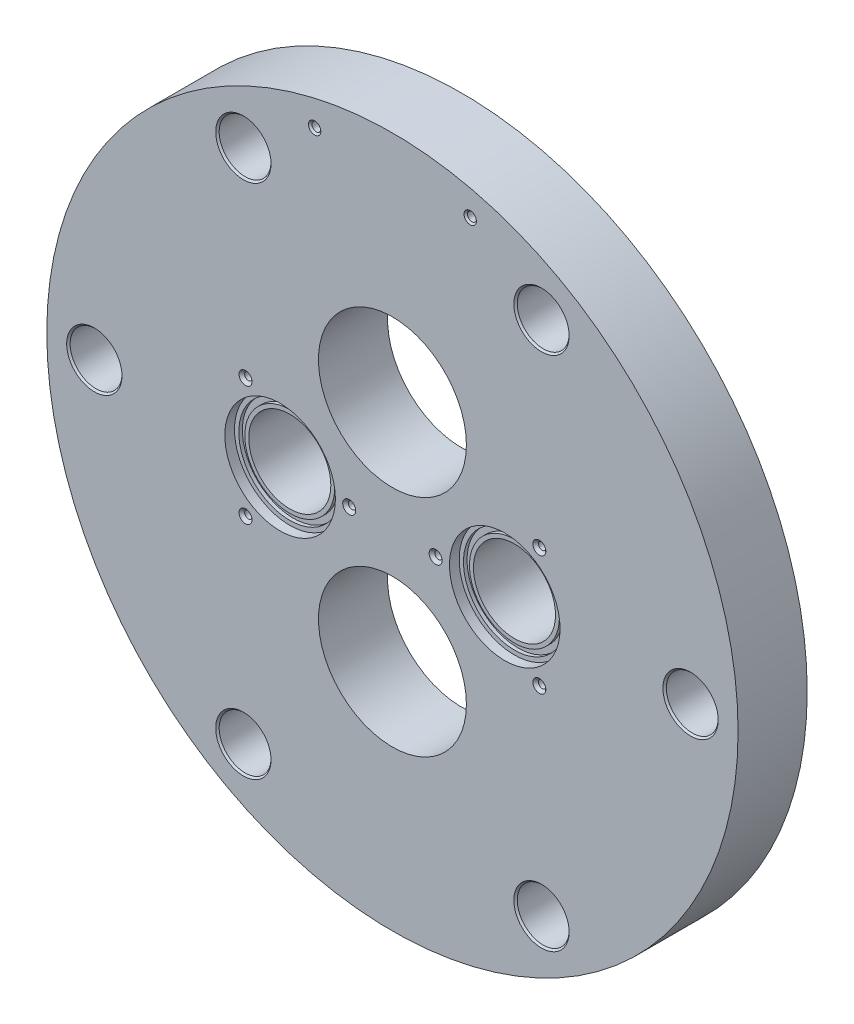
ISO-10303-21;
HEADER;
FILE_DESCRIPTION(('STEP AP214'),'2;1');
FILE_NAME('part.step','',(''),(''),'','','');
FILE_SCHEMA(('AUTOMOTIVE_DESIGN { 1 0 10303 214 1 1 1 1 }'));
ENDSEC;
DATA;
#1=APPLICATION_CONTEXT('core data for automotive mechanical design processes');
#2=APPLICATION_PROTOCOL_DEFINITION('international standard','automotive_design',2000,#1);
#3=PRODUCT_CONTEXT('',#1,'mechanical');
#4=PRODUCT('Part','Part','',(#3));
#5=PRODUCT_RELATED_PRODUCT_CATEGORY('part','',(#4));
#6=PRODUCT_DEFINITION_FORMATION('','',#4);
#7=PRODUCT_DEFINITION_CONTEXT('part definition',#1,'design');
#8=PRODUCT_DEFINITION('design','',#6,#7);
#9=PRODUCT_DEFINITION_SHAPE('','',#8);
#10=(LENGTH_UNIT() NAMED_UNIT(*) SI_UNIT(.MILLI.,.METRE.));
#11=(NAMED_UNIT(*) PLANE_ANGLE_UNIT() SI_UNIT($,.RADIAN.));
#12=(NAMED_UNIT(*) SI_UNIT($,.STERADIAN.) SOLID_ANGLE_UNIT());
#13=UNCERTAINTY_MEASURE_WITH_UNIT(LENGTH_MEASURE(1.E-05),#10,'distance_accuracy_value','');
#14=(GEOMETRIC_REPRESENTATION_CONTEXT(3) GLOBAL_UNCERTAINTY_ASSIGNED_CONTEXT((#13)) GLOBAL_UNIT_ASSIGNED_CONTEXT((#10,
#11,#12)) REPRESENTATION_CONTEXT('',''));
#15=CARTESIAN_POINT('',(0.,0.,0.));
#16=DIRECTION('',(0.,0.,1.));
#17=DIRECTION('',(1.,0.,0.));
#18=AXIS2_PLACEMENT_3D('',#15,#16,#17);
#19=CARTESIAN_POINT('',(41.275,0.,21.844));
#20=DIRECTION('',(0.,0.,1.));
#21=DIRECTION('',(1.,0.,0.));
#22=AXIS2_PLACEMENT_3D('',#19,#20,#21);
#23=PLANE('',#22);
#24=CARTESIAN_POINT('',(41.275,0.,21.844));
#25=DIRECTION('',(0.,0.,1.));
#26=DIRECTION('',(1.,0.,0.));
#27=AXIS2_PLACEMENT_3D('',#24,#25,#26);
#28=CIRCLE('',#27,15.08125);
#29=CARTESIAN_POINT('',(56.35625,0.,21.844));
#30=VERTEX_POINT('',#29);
#31=EDGE_CURVE('E355',#30,#30,#28,.F.);
#32=ORIENTED_EDGE('',*,*,#31,.T.);
#33=EDGE_LOOP('',(#32));
#34=FACE_BOUND('',#33,.T.);
#35=CARTESIAN_POINT('',(41.275,0.,21.844));
#36=DIRECTION('',(0.,0.,1.));
#37=DIRECTION('',(1.,0.,0.));
#38=AXIS2_PLACEMENT_3D('',#35,#36,#37);
#39=CIRCLE('',#38,16.5227);
#40=CARTESIAN_POINT('',(57.7977,0.,21.844));
#41=VERTEX_POINT('',#40);
#42=EDGE_CURVE('E1392',#41,#41,#39,.T.);
#43=ORIENTED_EDGE('',*,*,#42,.T.);
#44=EDGE_LOOP('',(#43));
#45=FACE_BOUND('',#44,.T.);
#46=ADVANCED_FACE('F45',(#34,#45),#23,.T.);
#47=CARTESIAN_POINT('',(-41.275,0.,21.844));
#48=DIRECTION('',(0.,0.,1.));
#49=DIRECTION('',(1.,0.,0.));
#50=AXIS2_PLACEMENT_3D('',#47,#48,#49);
#51=PLANE('',#50);
#52=CARTESIAN_POINT('',(-41.275,0.,21.844));
#53=DIRECTION('',(0.,0.,1.));
#54=DIRECTION('',(1.,0.,0.));
#55=AXIS2_PLACEMENT_3D('',#52,#53,#54);
#56=CIRCLE('',#55,15.08125);
#57=CARTESIAN_POINT('',(-26.19375,0.,21.844));
#58=VERTEX_POINT('',#57);
#59=EDGE_CURVE('E49',#58,#58,#56,.F.);
#60=ORIENTED_EDGE('',*,*,#59,.T.);
#61=EDGE_LOOP('',(#60));
#62=FACE_BOUND('',#61,.T.);
#63=CARTESIAN_POINT('',(-41.275,0.,21.844));
#64=DIRECTION('',(0.,0.,1.));
#65=DIRECTION('',(1.,0.,0.));
#66=AXIS2_PLACEMENT_3D('',#63,#64,#65);
#67=CIRCLE('',#66,16.5227);
#68=CARTESIAN_POINT('',(-24.7523,0.,21.844));
#69=VERTEX_POINT('',#68);
#70=EDGE_CURVE('E1398',#69,#69,#67,.T.);
#71=ORIENTED_EDGE('',*,*,#70,.T.);
#72=EDGE_LOOP('',(#71));
#73=FACE_BOUND('',#72,.T.);
#74=ADVANCED_FACE('F473',(#62,#73),#51,.T.);
#75=CARTESIAN_POINT('',(0.,0.,0.));
#76=DIRECTION('',(0.,0.,1.));
#77=DIRECTION('',(1.,0.,0.));
#78=AXIS2_PLACEMENT_3D('',#75,#76,#77);
#79=PLANE('',#78);
#80=CARTESIAN_POINT('',(34.925,41.275,0.));
#81=DIRECTION('',(0.,0.,-1.));
#82=DIRECTION('',(-1.,0.,0.));
#83=AXIS2_PLACEMENT_3D('',#80,#81,#82);
#84=CIRCLE('',#83,2.7178);
#85=CARTESIAN_POINT('',(32.2072,41.275,0.));
#86=VERTEX_POINT('',#85);
#87=EDGE_CURVE('E131',#86,#86,#84,.T.);
#88=ORIENTED_EDGE('',*,*,#87,.F.);
#89=EDGE_LOOP('',(#88));
#90=FACE_BOUND('',#89,.T.);
#91=CARTESIAN_POINT('',(17.4625,71.5209372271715,0.));
#92=DIRECTION('',(0.,0.,-1.));
#93=DIRECTION('',(-1.,0.,0.));
#94=AXIS2_PLACEMENT_3D('',#91,#92,#93);
#95=CIRCLE('',#94,2.7178);
#96=CARTESIAN_POINT('',(14.7447,71.5209372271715,0.));
#97=VERTEX_POINT('',#96);
#98=EDGE_CURVE('E122',#97,#97,#95,.T.);
#99=ORIENTED_EDGE('',*,*,#98,.F.);
#100=EDGE_LOOP('',(#99));
#101=FACE_BOUND('',#100,.T.);
#102=CARTESIAN_POINT('',(-17.4625,71.5209372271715,0.));
#103=DIRECTION('',(0.,0.,-1.));
#104=DIRECTION('',(-1.,0.,0.));
#105=AXIS2_PLACEMENT_3D('',#102,#103,#104);
#106=CIRCLE('',#105,2.7178);
#107=CARTESIAN_POINT('',(-20.1803,71.5209372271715,0.));
#108=VERTEX_POINT('',#107);
#109=EDGE_CURVE('E142',#108,#108,#106,.T.);
#110=ORIENTED_EDGE('',*,*,#109,.F.);
#111=EDGE_LOOP('',(#110));
#112=FACE_BOUND('',#111,.T.);
#113=CARTESIAN_POINT('',(-34.925,41.275,0.));
#114=DIRECTION('',(0.,0.,-1.));
#115=DIRECTION('',(-1.,0.,0.));
#116=AXIS2_PLACEMENT_3D('',#113,#114,#115);
#117=CIRCLE('',#116,2.7178);
#118=CARTESIAN_POINT('',(-37.6428,41.275,0.));
#119=VERTEX_POINT('',#118);
#120=EDGE_CURVE('E154',#119,#119,#117,.T.);
#121=ORIENTED_EDGE('',*,*,#120,.F.);
#122=EDGE_LOOP('',(#121));
#123=FACE_BOUND('',#122,.T.);
#124=CARTESIAN_POINT('',(-17.4625,11.0290627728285,0.));
#125=DIRECTION('',(0.,0.,-1.));
#126=DIRECTION('',(-1.,0.,0.));
#127=AXIS2_PLACEMENT_3D('',#124,#125,#126);
#128=CIRCLE('',#127,2.7178);
#129=CARTESIAN_POINT('',(-20.1803,11.0290627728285,0.));
#130=VERTEX_POINT('',#129);
#131=EDGE_CURVE('E166',#130,#130,#128,.T.);
#132=ORIENTED_EDGE('',*,*,#131,.F.);
#133=EDGE_LOOP('',(#132));
#134=FACE_BOUND('',#133,.T.);
#135=CARTESIAN_POINT('',(17.4625,11.0290627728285,0.));
#136=DIRECTION('',(0.,0.,-1.));
#137=DIRECTION('',(-1.,0.,0.));
#138=AXIS2_PLACEMENT_3D('',#135,#136,#137);
#139=CIRCLE('',#138,2.7178);
#140=CARTESIAN_POINT('',(14.7447,11.0290627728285,0.));
#141=VERTEX_POINT('',#140);
#142=EDGE_CURVE('E178',#141,#141,#139,.T.);
#143=ORIENTED_EDGE('',*,*,#142,.F.);
#144=EDGE_LOOP('',(#143));
#145=FACE_BOUND('',#144,.T.);
#146=CARTESIAN_POINT('',(17.4625,-11.0290627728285,0.));
#147=DIRECTION('',(0.,0.,-1.));
#148=DIRECTION('',(-1.,0.,0.));
#149=AXIS2_PLACEMENT_3D('',#146,#147,#148);
#150=CIRCLE('',#149,2.7178);
#151=CARTESIAN_POINT('',(14.7447,-11.0290627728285,0.));
#152=VERTEX_POINT('',#151);
#153=EDGE_CURVE('E190',#152,#152,#150,.T.);
#154=ORIENTED_EDGE('',*,*,#153,.F.);
#155=EDGE_LOOP('',(#154));
#156=FACE_BOUND('',#155,.T.);
#157=CARTESIAN_POINT('',(-17.4625,-11.0290627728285,0.));
#158=DIRECTION('',(0.,0.,-1.));
#159=DIRECTION('',(-1.,0.,0.));
#160=AXIS2_PLACEMENT_3D('',#157,#158,#159);
#161=CIRCLE('',#160,2.7178);
#162=CARTESIAN_POINT('',(-20.1803,-11.0290627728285,0.));
#163=VERTEX_POINT('',#162);
#164=EDGE_CURVE('E202',#163,#163,#161,.T.);
#165=ORIENTED_EDGE('',*,*,#164,.F.);
#166=EDGE_LOOP('',(#165));
#167=FACE_BOUND('',#166,.T.);
#168=CARTESIAN_POINT('',(-34.925,-41.275,0.));
#169=DIRECTION('',(0.,0.,-1.));
#170=DIRECTION('',(-1.,0.,0.));
#171=AXIS2_PLACEMENT_3D('',#168,#169,#170);
#172=CIRCLE('',#171,2.7178);
#173=CARTESIAN_POINT('',(-37.6428,-41.275,0.));
#174=VERTEX_POINT('',#173);
#175=EDGE_CURVE('E214',#174,#174,#172,.T.);
#176=ORIENTED_EDGE('',*,*,#175,.F.);
#177=EDGE_LOOP('',(#176));
#178=FACE_BOUND('',#177,.T.);
#179=CARTESIAN_POINT('',(-17.4625,-71.5209372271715,0.));
#180=DIRECTION('',(0.,0.,-1.));
#181=DIRECTION('',(-1.,0.,0.));
#182=AXIS2_PLACEMENT_3D('',#179,#180,#181);
#183=CIRCLE('',#182,2.7178);
#184=CARTESIAN_POINT('',(-20.1803,-71.5209372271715,0.));
#185=VERTEX_POINT('',#184);
#186=EDGE_CURVE('E226',#185,#185,#183,.T.);
#187=ORIENTED_EDGE('',*,*,#186,.F.);
#188=EDGE_LOOP('',(#187));
#189=FACE_BOUND('',#188,.T.);
#190=CARTESIAN_POINT('',(17.4625,-71.5209372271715,0.));
#191=DIRECTION('',(0.,0.,-1.));
#192=DIRECTION('',(-1.,0.,0.));
#193=AXIS2_PLACEMENT_3D('',#190,#191,#192);
#194=CIRCLE('',#193,2.7178);
#195=CARTESIAN_POINT('',(14.7447,-71.5209372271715,0.));
#196=VERTEX_POINT('',#195);
#197=EDGE_CURVE('E238',#196,#196,#194,.T.);
#198=ORIENTED_EDGE('',*,*,#197,.F.);
#199=EDGE_LOOP('',(#198));
#200=FACE_BOUND('',#199,.T.);
#201=CARTESIAN_POINT('',(34.925,-41.275,0.));
#202=DIRECTION('',(0.,0.,-1.));
#203=DIRECTION('',(-1.,0.,0.));
#204=AXIS2_PLACEMENT_3D('',#201,#202,#203);
#205=CIRCLE('',#204,2.7178);
#206=CARTESIAN_POINT('',(32.2072,-41.275,0.));
#207=VERTEX_POINT('',#206);
#208=EDGE_CURVE('E250',#207,#207,#205,.T.);
#209=ORIENTED_EDGE('',*,*,#208,.F.);
#210=EDGE_LOOP('',(#209));
#211=FACE_BOUND('',#210,.T.);
#212=CARTESIAN_POINT('',(0.,-41.275,0.));
#213=DIRECTION('',(0.,0.,1.));
#214=DIRECTION('',(1.,0.,0.));
#215=AXIS2_PLACEMENT_3D('',#212,#213,#214);
#216=CIRCLE('',#215,27.178);
#217=CARTESIAN_POINT('',(27.178,-41.275,0.));
#218=VERTEX_POINT('',#217);
#219=EDGE_CURVE('E385',#218,#218,#216,.T.);
#220=ORIENTED_EDGE('',*,*,#219,.T.);
#221=EDGE_LOOP('',(#220));
#222=FACE_BOUND('',#221,.T.);
#223=CARTESIAN_POINT('',(0.,41.275,0.));
#224=DIRECTION('',(0.,0.,1.));
#225=DIRECTION('',(1.,0.,0.));
#226=AXIS2_PLACEMENT_3D('',#223,#224,#225);
#227=CIRCLE('',#226,27.178);
#228=CARTESIAN_POINT('',(27.178,41.275,0.));
#229=VERTEX_POINT('',#228);
#230=EDGE_CURVE('E376',#229,#229,#227,.T.);
#231=ORIENTED_EDGE('',*,*,#230,.T.);
#232=EDGE_LOOP('',(#231));
#233=FACE_BOUND('',#232,.T.);
#234=CARTESIAN_POINT('',(-41.275,0.,0.));
#235=DIRECTION('',(0.,0.,1.));
#236=DIRECTION('',(1.,0.,0.));
#237=AXIS2_PLACEMENT_3D('',#234,#235,#236);
#238=CIRCLE('',#237,15.08125);
#239=CARTESIAN_POINT('',(-26.19375,0.,0.));
#240=VERTEX_POINT('',#239);
#241=EDGE_CURVE('E372',#240,#240,#238,.T.);
#242=ORIENTED_EDGE('',*,*,#241,.T.);
#243=EDGE_LOOP('',(#242));
#244=FACE_BOUND('',#243,.T.);
#245=CARTESIAN_POINT('',(41.275,0.,0.));
#246=DIRECTION('',(0.,0.,1.));
#247=DIRECTION('',(1.,0.,0.));
#248=AXIS2_PLACEMENT_3D('',#245,#246,#247);
#249=CIRCLE('',#248,15.08125);
#250=CARTESIAN_POINT('',(56.35625,0.,0.));
#251=VERTEX_POINT('',#250);
#252=EDGE_CURVE('E367',#251,#251,#249,.T.);
#253=ORIENTED_EDGE('',*,*,#252,.T.);
#254=EDGE_LOOP('',(#253));
#255=FACE_BOUND('',#254,.T.);
#256=CARTESIAN_POINT('',(0.,0.,0.));
#257=DIRECTION('',(0.,0.,-1.));
#258=DIRECTION('',(-1.,0.,0.));
#259=AXIS2_PLACEMENT_3D('',#256,#257,#258);
#260=CIRCLE('',#259,95.0468);
#261=CARTESIAN_POINT('',(-95.0468,0.,0.));
#262=VERTEX_POINT('',#261);
#263=EDGE_CURVE('E262',#262,#262,#260,.T.);
#264=ORIENTED_EDGE('',*,*,#263,.T.);
#265=EDGE_LOOP('',(#264));
#266=FACE_BOUND('',#265,.T.);
#267=ADVANCED_FACE('F479',(#90,#101,#112,#123,#134,#145,#156,#167,#178,#189,#200,#211,#222,#233,
#244,#255,#266),#79,.F.);
#268=CARTESIAN_POINT('',(-41.275,0.,0.));
#269=DIRECTION('',(0.,0.,1.));
#270=DIRECTION('',(1.,0.,0.));
#271=AXIS2_PLACEMENT_3D('',#268,#269,#270);
#272=CYLINDRICAL_SURFACE('',#271,15.08125);
#273=ORIENTED_EDGE('',*,*,#241,.F.);
#274=EDGE_LOOP('',(#273));
#275=FACE_BOUND('',#274,.T.);
#276=ORIENTED_EDGE('',*,*,#59,.F.);
#277=EDGE_LOOP('',(#276));
#278=FACE_BOUND('',#277,.T.);
#279=ADVANCED_FACE('F476',(#275,#278),#272,.F.);
#280=CARTESIAN_POINT('',(41.275,0.,0.));
#281=DIRECTION('',(0.,0.,1.));
#282=DIRECTION('',(1.,0.,0.));
#283=AXIS2_PLACEMENT_3D('',#280,#281,#282);
#284=CYLINDRICAL_SURFACE('',#283,15.08125);
#285=ORIENTED_EDGE('',*,*,#252,.F.);
#286=EDGE_LOOP('',(#285));
#287=FACE_BOUND('',#286,.T.);
#288=ORIENTED_EDGE('',*,*,#31,.F.);
#289=EDGE_LOOP('',(#288));
#290=FACE_BOUND('',#289,.T.);
#291=ADVANCED_FACE('F478',(#287,#290),#284,.F.);
#292=CARTESIAN_POINT('',(0.,0.,25.4));
#293=DIRECTION('',(0.,0.,-1.));
#294=DIRECTION('',(-1.,0.,0.));
#295=AXIS2_PLACEMENT_3D('',#292,#293,#294);
#296=CYLINDRICAL_SURFACE('',#295,127.);
#297=CARTESIAN_POINT('',(0.,0.,25.4));
#298=DIRECTION('',(0.,0.,1.));
#299=DIRECTION('',(1.,0.,0.));
#300=AXIS2_PLACEMENT_3D('',#297,#298,#299);
#301=CIRCLE('',#300,127.);
#302=CARTESIAN_POINT('',(127.,0.,25.4));
#303=VERTEX_POINT('',#302);
#304=EDGE_CURVE('E11',#303,#303,#301,.T.);
#305=ORIENTED_EDGE('',*,*,#304,.F.);
#306=EDGE_LOOP('',(#305));
#307=FACE_BOUND('',#306,.T.);
#308=CARTESIAN_POINT('',(0.,0.,0.));
#309=DIRECTION('',(0.,0.,1.));
#310=DIRECTION('',(1.,0.,0.));
#311=AXIS2_PLACEMENT_3D('',#308,#309,#310);
#312=CIRCLE('',#311,127.);
#313=CARTESIAN_POINT('',(127.,0.,0.));
#314=VERTEX_POINT('',#313);
#315=EDGE_CURVE('E55',#314,#314,#312,.T.);
#316=ORIENTED_EDGE('',*,*,#315,.T.);
#317=EDGE_LOOP('',(#316));
#318=FACE_BOUND('',#317,.T.);
#319=ADVANCED_FACE('F47',(#307,#318),#296,.T.);
#320=CARTESIAN_POINT('',(0.,0.,25.4));
#321=DIRECTION('',(0.,0.,1.));
#322=DIRECTION('',(1.,0.,0.));
#323=AXIS2_PLACEMENT_3D('',#320,#321,#322);
#324=PLANE('',#323);
#325=CARTESIAN_POINT('',(-28.575,114.3,25.4));
#326=DIRECTION('',(0.,0.,1.));
#327=DIRECTION('',(1.,0.,0.));
#328=AXIS2_PLACEMENT_3D('',#325,#326,#327);
#329=CIRCLE('',#328,2.26695);
#330=CARTESIAN_POINT('',(-26.30805,114.3,25.4));
#331=VERTEX_POINT('',#330);
#332=EDGE_CURVE('E1371',#331,#331,#329,.T.);
#333=ORIENTED_EDGE('',*,*,#332,.F.);
#334=EDGE_LOOP('',(#333));
#335=FACE_BOUND('',#334,.T.);
#336=CARTESIAN_POINT('',(28.575,114.3,25.4));
#337=DIRECTION('',(0.,0.,1.));
#338=DIRECTION('',(1.,0.,0.));
#339=AXIS2_PLACEMENT_3D('',#336,#337,#338);
#340=CIRCLE('',#339,2.26695);
#341=CARTESIAN_POINT('',(30.84195,114.3,25.4));
#342=VERTEX_POINT('',#341);
#343=EDGE_CURVE('E1380',#342,#342,#340,.T.);
#344=ORIENTED_EDGE('',*,*,#343,.F.);
#345=EDGE_LOOP('',(#344));
#346=FACE_BOUND('',#345,.T.);
#347=CARTESIAN_POINT('',(15.875,0.,25.4));
#348=DIRECTION('',(0.,0.,1.));
#349=DIRECTION('',(1.,0.,0.));
#350=AXIS2_PLACEMENT_3D('',#347,#348,#349);
#351=CIRCLE('',#350,2.3876);
#352=CARTESIAN_POINT('',(18.2626,0.,25.4));
#353=VERTEX_POINT('',#352);
#354=EDGE_CURVE('E275',#353,#353,#351,.T.);
#355=ORIENTED_EDGE('',*,*,#354,.F.);
#356=EDGE_LOOP('',(#355));
#357=FACE_BOUND('',#356,.T.);
#358=CARTESIAN_POINT('',(53.9750000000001,21.9970452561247,25.4));
#359=DIRECTION('',(0.,0.,1.));
#360=DIRECTION('',(1.,0.,0.));
#361=AXIS2_PLACEMENT_3D('',#358,#359,#360);
#362=CIRCLE('',#361,2.3876);
#363=CARTESIAN_POINT('',(56.3626000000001,21.9970452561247,25.4));
#364=VERTEX_POINT('',#363);
#365=EDGE_CURVE('E290',#364,#364,#362,.T.);
#366=ORIENTED_EDGE('',*,*,#365,.F.);
#367=EDGE_LOOP('',(#366));
#368=FACE_BOUND('',#367,.T.);
#369=CARTESIAN_POINT('',(53.9749999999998,-21.9970452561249,25.4));
#370=DIRECTION('',(0.,0.,1.));
#371=DIRECTION('',(1.,0.,0.));
#372=AXIS2_PLACEMENT_3D('',#369,#370,#371);
#373=CIRCLE('',#372,2.3876);
#374=CARTESIAN_POINT('',(56.3625999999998,-21.9970452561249,25.4));
#375=VERTEX_POINT('',#374);
#376=EDGE_CURVE('E302',#375,#375,#373,.T.);
#377=ORIENTED_EDGE('',*,*,#376,.F.);
#378=EDGE_LOOP('',(#377));
#379=FACE_BOUND('',#378,.T.);
#380=CARTESIAN_POINT('',(-15.875,0.,25.4));
#381=DIRECTION('',(0.,0.,1.));
#382=DIRECTION('',(1.,0.,0.));
#383=AXIS2_PLACEMENT_3D('',#380,#381,#382);
#384=CIRCLE('',#383,2.3876);
#385=CARTESIAN_POINT('',(-13.4874,0.,25.4));
#386=VERTEX_POINT('',#385);
#387=EDGE_CURVE('E314',#386,#386,#384,.T.);
#388=ORIENTED_EDGE('',*,*,#387,.F.);
#389=EDGE_LOOP('',(#388));
#390=FACE_BOUND('',#389,.T.);
#391=CARTESIAN_POINT('',(-53.9749999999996,-21.9970452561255,25.4));
#392=DIRECTION('',(0.,0.,1.));
#393=DIRECTION('',(1.,0.,0.));
#394=AXIS2_PLACEMENT_3D('',#391,#392,#393);
#395=CIRCLE('',#394,2.3876);
#396=CARTESIAN_POINT('',(-51.5873999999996,-21.9970452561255,25.4));
#397=VERTEX_POINT('',#396);
#398=EDGE_CURVE('E326',#397,#397,#395,.T.);
#399=ORIENTED_EDGE('',*,*,#398,.F.);
#400=EDGE_LOOP('',(#399));
#401=FACE_BOUND('',#400,.T.);
#402=CARTESIAN_POINT('',(-53.9750000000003,21.9970452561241,25.4));
#403=DIRECTION('',(0.,0.,1.));
#404=DIRECTION('',(1.,0.,0.));
#405=AXIS2_PLACEMENT_3D('',#402,#403,#404);
#406=CIRCLE('',#405,2.3876);
#407=CARTESIAN_POINT('',(-51.5874000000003,21.9970452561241,25.4));
#408=VERTEX_POINT('',#407);
#409=EDGE_CURVE('E338',#408,#408,#406,.T.);
#410=ORIENTED_EDGE('',*,*,#409,.F.);
#411=EDGE_LOOP('',(#410));
#412=FACE_BOUND('',#411,.T.);
#413=CARTESIAN_POINT('',(-41.275,0.,25.4));
#414=DIRECTION('',(0.,0.,1.));
#415=DIRECTION('',(1.,0.,0.));
#416=AXIS2_PLACEMENT_3D('',#413,#414,#415);
#417=CIRCLE('',#416,20.32);
#418=CARTESIAN_POINT('',(-20.955,0.,25.4));
#419=VERTEX_POINT('',#418);
#420=EDGE_CURVE('E356',#419,#419,#417,.T.);
#421=ORIENTED_EDGE('',*,*,#420,.F.);
#422=EDGE_LOOP('',(#421));
#423=FACE_BOUND('',#422,.T.);
#424=CARTESIAN_POINT('',(41.275,0.,25.4));
#425=DIRECTION('',(0.,0.,1.));
#426=DIRECTION('',(1.,0.,0.));
#427=AXIS2_PLACEMENT_3D('',#424,#425,#426);
#428=CIRCLE('',#427,20.32);
#429=CARTESIAN_POINT('',(61.595,0.,25.4));
#430=VERTEX_POINT('',#429);
#431=EDGE_CURVE('E350',#430,#430,#428,.T.);
#432=ORIENTED_EDGE('',*,*,#431,.F.);
#433=EDGE_LOOP('',(#432));
#434=FACE_BOUND('',#433,.T.);
#435=CARTESIAN_POINT('',(0.,41.275,25.4));
#436=DIRECTION('',(0.,0.,1.));
#437=DIRECTION('',(1.,0.,0.));
#438=AXIS2_PLACEMENT_3D('',#435,#436,#437);
#439=CIRCLE('',#438,27.178);
#440=CARTESIAN_POINT('',(27.178,41.275,25.4));
#441=VERTEX_POINT('',#440);
#442=EDGE_CURVE('E381',#441,#441,#439,.T.);
#443=ORIENTED_EDGE('',*,*,#442,.F.);
#444=EDGE_LOOP('',(#443));
#445=FACE_BOUND('',#444,.T.);
#446=CARTESIAN_POINT('',(0.,-41.275,25.4));
#447=DIRECTION('',(0.,0.,1.));
#448=DIRECTION('',(1.,0.,0.));
#449=AXIS2_PLACEMENT_3D('',#446,#447,#448);
#450=CIRCLE('',#449,27.178);
#451=CARTESIAN_POINT('',(27.178,-41.275,25.4));
#452=VERTEX_POINT('',#451);
#453=EDGE_CURVE('E371',#452,#452,#450,.T.);
#454=ORIENTED_EDGE('',*,*,#453,.F.);
#455=EDGE_LOOP('',(#454));
#456=FACE_BOUND('',#455,.T.);
#457=CARTESIAN_POINT('',(-109.5375,0.,25.4));
#458=DIRECTION('',(0.,0.,1.));
#459=DIRECTION('',(1.,0.,0.));
#460=AXIS2_PLACEMENT_3D('',#457,#458,#459);
#461=CIRCLE('',#460,10.16);
#462=CARTESIAN_POINT('',(-99.3775,0.,25.4));
#463=VERTEX_POINT('',#462);
#464=EDGE_CURVE('E380',#463,#463,#461,.T.);
#465=ORIENTED_EDGE('',*,*,#464,.F.);
#466=EDGE_LOOP('',(#465));
#467=FACE_BOUND('',#466,.T.);
#468=CARTESIAN_POINT('',(-54.7687499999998,94.8622576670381,25.4));
#469=DIRECTION('',(0.,0.,1.));
#470=DIRECTION('',(1.,0.,0.));
#471=AXIS2_PLACEMENT_3D('',#468,#469,#470);
#472=CIRCLE('',#471,10.16);
#473=CARTESIAN_POINT('',(-44.6087499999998,94.8622576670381,25.4));
#474=VERTEX_POINT('',#473);
#475=EDGE_CURVE('E403',#474,#474,#472,.T.);
#476=ORIENTED_EDGE('',*,*,#475,.F.);
#477=EDGE_LOOP('',(#476));
#478=FACE_BOUND('',#477,.T.);
#479=CARTESIAN_POINT('',(54.7687500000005,94.8622576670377,25.4));
#480=DIRECTION('',(0.,0.,1.));
#481=DIRECTION('',(1.,0.,0.));
#482=AXIS2_PLACEMENT_3D('',#479,#480,#481);
#483=CIRCLE('',#482,10.16);
#484=CARTESIAN_POINT('',(64.9287500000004,94.8622576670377,25.4));
#485=VERTEX_POINT('',#484);
#486=EDGE_CURVE('E415',#485,#485,#483,.T.);
#487=ORIENTED_EDGE('',*,*,#486,.F.);
#488=EDGE_LOOP('',(#487));
#489=FACE_BOUND('',#488,.T.);
#490=CARTESIAN_POINT('',(109.5375,-7.64896274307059E-13,25.4));
#491=DIRECTION('',(0.,0.,1.));
#492=DIRECTION('',(1.,0.,0.));
#493=AXIS2_PLACEMENT_3D('',#490,#491,#492);
#494=CIRCLE('',#493,10.16);
#495=CARTESIAN_POINT('',(119.6975,-7.64896274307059E-13,25.4));
#496=VERTEX_POINT('',#495);
#497=EDGE_CURVE('E427',#496,#496,#494,.T.);
#498=ORIENTED_EDGE('',*,*,#497,.F.);
#499=EDGE_LOOP('',(#498));
#500=FACE_BOUND('',#499,.T.);
#501=CARTESIAN_POINT('',(54.7687499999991,-94.8622576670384,25.4));
#502=DIRECTION('',(0.,0.,1.));
#503=DIRECTION('',(1.,0.,0.));
#504=AXIS2_PLACEMENT_3D('',#501,#502,#503);
#505=CIRCLE('',#504,10.16);
#506=CARTESIAN_POINT('',(64.9287499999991,-94.8622576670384,25.4));
#507=VERTEX_POINT('',#506);
#508=EDGE_CURVE('E439',#507,#507,#505,.T.);
#509=ORIENTED_EDGE('',*,*,#508,.F.);
#510=EDGE_LOOP('',(#509));
#511=FACE_BOUND('',#510,.T.);
#512=CARTESIAN_POINT('',(-54.7687500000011,-94.8622576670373,25.4));
#513=DIRECTION('',(0.,0.,1.));
#514=DIRECTION('',(1.,0.,0.));
#515=AXIS2_PLACEMENT_3D('',#512,#513,#514);
#516=CIRCLE('',#515,10.16);
#517=CARTESIAN_POINT('',(-44.6087500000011,-94.8622576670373,25.4));
#518=VERTEX_POINT('',#517);
#519=EDGE_CURVE('E451',#518,#518,#516,.T.);
#520=ORIENTED_EDGE('',*,*,#519,.F.);
#521=EDGE_LOOP('',(#520));
#522=FACE_BOUND('',#521,.T.);
#523=ORIENTED_EDGE('',*,*,#304,.T.);
#524=EDGE_LOOP('',(#523));
#525=FACE_BOUND('',#524,.T.);
#526=ADVANCED_FACE('F522',(#335,#346,#357,#368,#379,#390,#401,#412,#423,#434,#445,#456,#467,
#478,#489,#500,#511,#522,#525),#324,.T.);
#527=CARTESIAN_POINT('',(-28.575,114.3,0.));
#528=DIRECTION('',(0.,0.,1.));
#529=DIRECTION('',(1.,0.,0.));
#530=AXIS2_PLACEMENT_3D('',#527,#528,#529);
#531=CIRCLE('',#530,1.63194999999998);
#532=CARTESIAN_POINT('',(-26.94305,114.3,0.));
#533=VERTEX_POINT('',#532);
#534=EDGE_CURVE('E1375',#533,#533,#531,.T.);
#535=ORIENTED_EDGE('',*,*,#534,.T.);
#536=EDGE_LOOP('',(#535));
#537=FACE_BOUND('',#536,.T.);
#538=CARTESIAN_POINT('',(28.575,114.3,0.));
#539=DIRECTION('',(0.,0.,1.));
#540=DIRECTION('',(1.,0.,0.));
#541=AXIS2_PLACEMENT_3D('',#538,#539,#540);
#542=CIRCLE('',#541,1.63194999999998);
#543=CARTESIAN_POINT('',(30.20695,114.3,0.));
#544=VERTEX_POINT('',#543);
#545=EDGE_CURVE('E1388',#544,#544,#542,.T.);
#546=ORIENTED_EDGE('',*,*,#545,.T.);
#547=EDGE_LOOP('',(#546));
#548=FACE_BOUND('',#547,.T.);
#549=CARTESIAN_POINT('',(0.,0.,0.));
#550=DIRECTION('',(0.,0.,-1.));
#551=DIRECTION('',(-1.,0.,0.));
#552=AXIS2_PLACEMENT_3D('',#549,#550,#551);
#553=CIRCLE('',#552,99.1362);
#554=CARTESIAN_POINT('',(-99.1362,0.,0.));
#555=VERTEX_POINT('',#554);
#556=EDGE_CURVE('E267',#555,#555,#553,.T.);
#557=ORIENTED_EDGE('',*,*,#556,.F.);
#558=EDGE_LOOP('',(#557));
#559=FACE_BOUND('',#558,.T.);
#560=CARTESIAN_POINT('',(-109.5375,0.,0.));
#561=DIRECTION('',(0.,0.,1.));
#562=DIRECTION('',(1.,0.,0.));
#563=AXIS2_PLACEMENT_3D('',#560,#561,#562);
#564=CIRCLE('',#563,9.52499999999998);
#565=CARTESIAN_POINT('',(-100.0125,0.,0.));
#566=VERTEX_POINT('',#565);
#567=EDGE_CURVE('E399',#566,#566,#564,.T.);
#568=ORIENTED_EDGE('',*,*,#567,.T.);
#569=EDGE_LOOP('',(#568));
#570=FACE_BOUND('',#569,.T.);
#571=CARTESIAN_POINT('',(-54.7687499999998,94.8622576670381,0.));
#572=DIRECTION('',(0.,0.,1.));
#573=DIRECTION('',(1.,0.,0.));
#574=AXIS2_PLACEMENT_3D('',#571,#572,#573);
#575=CIRCLE('',#574,9.52499999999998);
#576=CARTESIAN_POINT('',(-45.2437499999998,94.8622576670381,0.));
#577=VERTEX_POINT('',#576);
#578=EDGE_CURVE('E411',#577,#577,#575,.T.);
#579=ORIENTED_EDGE('',*,*,#578,.T.);
#580=EDGE_LOOP('',(#579));
#581=FACE_BOUND('',#580,.T.);
#582=CARTESIAN_POINT('',(54.7687500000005,94.8622576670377,0.));
#583=DIRECTION('',(0.,0.,1.));
#584=DIRECTION('',(1.,0.,0.));
#585=AXIS2_PLACEMENT_3D('',#582,#583,#584);
#586=CIRCLE('',#585,9.52499999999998);
#587=CARTESIAN_POINT('',(64.2937500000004,94.8622576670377,0.));
#588=VERTEX_POINT('',#587);
#589=EDGE_CURVE('E423',#588,#588,#586,.T.);
#590=ORIENTED_EDGE('',*,*,#589,.T.);
#591=EDGE_LOOP('',(#590));
#592=FACE_BOUND('',#591,.T.);
#593=CARTESIAN_POINT('',(109.5375,-7.64896274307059E-13,0.));
#594=DIRECTION('',(0.,0.,1.));
#595=DIRECTION('',(1.,0.,0.));
#596=AXIS2_PLACEMENT_3D('',#593,#594,#595);
#597=CIRCLE('',#596,9.52499999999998);
#598=CARTESIAN_POINT('',(119.0625,-7.64896274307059E-13,0.));
#599=VERTEX_POINT('',#598);
#600=EDGE_CURVE('E435',#599,#599,#597,.T.);
#601=ORIENTED_EDGE('',*,*,#600,.T.);
#602=EDGE_LOOP('',(#601));
#603=FACE_BOUND('',#602,.T.);
#604=CARTESIAN_POINT('',(54.7687499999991,-94.8622576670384,0.));
#605=DIRECTION('',(0.,0.,1.));
#606=DIRECTION('',(1.,0.,0.));
#607=AXIS2_PLACEMENT_3D('',#604,#605,#606);
#608=CIRCLE('',#607,9.52499999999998);
#609=CARTESIAN_POINT('',(64.2937499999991,-94.8622576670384,0.));
#610=VERTEX_POINT('',#609);
#611=EDGE_CURVE('E447',#610,#610,#608,.T.);
#612=ORIENTED_EDGE('',*,*,#611,.T.);
#613=EDGE_LOOP('',(#612));
#614=FACE_BOUND('',#613,.T.);
#615=CARTESIAN_POINT('',(-54.7687500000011,-94.8622576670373,0.));
#616=DIRECTION('',(0.,0.,1.));
#617=DIRECTION('',(1.,0.,0.));
#618=AXIS2_PLACEMENT_3D('',#615,#616,#617);
#619=CIRCLE('',#618,9.52499999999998);
#620=CARTESIAN_POINT('',(-45.2437500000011,-94.8622576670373,0.));
#621=VERTEX_POINT('',#620);
#622=EDGE_CURVE('E459',#621,#621,#619,.T.);
#623=ORIENTED_EDGE('',*,*,#622,.T.);
#624=EDGE_LOOP('',(#623));
#625=FACE_BOUND('',#624,.T.);
#626=ORIENTED_EDGE('',*,*,#315,.F.);
#627=EDGE_LOOP('',(#626));
#628=FACE_BOUND('',#627,.T.);
#629=ADVANCED_FACE('F489',(#537,#548,#559,#570,#581,#592,#603,#614,#625,#628),#79,.F.);
#630=CARTESIAN_POINT('',(-54.7687500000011,-94.8622576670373,25.4));
#631=DIRECTION('',(0.,0.,1.));
#632=DIRECTION('',(1.,0.,0.));
#633=AXIS2_PLACEMENT_3D('',#630,#631,#632);
#634=CYLINDRICAL_SURFACE('',#633,9.52499999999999);
#635=ORIENTED_EDGE('',*,*,#622,.F.);
#636=EDGE_LOOP('',(#635));
#637=FACE_BOUND('',#636,.T.);
#638=CARTESIAN_POINT('',(-54.7687500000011,-94.8622576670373,24.765));
#639=DIRECTION('',(0.,0.,1.));
#640=DIRECTION('',(1.,0.,0.));
#641=AXIS2_PLACEMENT_3D('',#638,#639,#640);
#642=CIRCLE('',#641,9.52499999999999);
#643=CARTESIAN_POINT('',(-45.2437500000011,-94.8622576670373,24.765));
#644=VERTEX_POINT('',#643);
#645=EDGE_CURVE('E455',#644,#644,#642,.T.);
#646=ORIENTED_EDGE('',*,*,#645,.T.);
#647=EDGE_LOOP('',(#646));
#648=FACE_BOUND('',#647,.T.);
#649=ADVANCED_FACE('F550',(#637,#648),#634,.F.);
#650=CARTESIAN_POINT('',(-54.7687500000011,-94.8622576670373,25.4));
#651=DIRECTION('',(0.,0.,1.));
#652=DIRECTION('',(1.,0.,0.));
#653=AXIS2_PLACEMENT_3D('',#650,#651,#652);
#654=CONICAL_SURFACE('',#653,10.16,0.785398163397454);
#655=ORIENTED_EDGE('',*,*,#645,.F.);
#656=EDGE_LOOP('',(#655));
#657=FACE_BOUND('',#656,.T.);
#658=ORIENTED_EDGE('',*,*,#519,.T.);
#659=EDGE_LOOP('',(#658));
#660=FACE_BOUND('',#659,.T.);
#661=ADVANCED_FACE('F555',(#657,#660),#654,.F.);
#662=CARTESIAN_POINT('',(54.7687499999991,-94.8622576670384,25.4));
#663=DIRECTION('',(0.,0.,1.));
#664=DIRECTION('',(1.,0.,0.));
#665=AXIS2_PLACEMENT_3D('',#662,#663,#664);
#666=CYLINDRICAL_SURFACE('',#665,9.52499999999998);
#667=ORIENTED_EDGE('',*,*,#611,.F.);
#668=EDGE_LOOP('',(#667));
#669=FACE_BOUND('',#668,.T.);
#670=CARTESIAN_POINT('',(54.7687499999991,-94.8622576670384,24.765));
#671=DIRECTION('',(0.,0.,1.));
#672=DIRECTION('',(1.,0.,0.));
#673=AXIS2_PLACEMENT_3D('',#670,#671,#672);
#674=CIRCLE('',#673,9.52499999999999);
#675=CARTESIAN_POINT('',(64.2937499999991,-94.8622576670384,24.765));
#676=VERTEX_POINT('',#675);
#677=EDGE_CURVE('E443',#676,#676,#674,.T.);
#678=ORIENTED_EDGE('',*,*,#677,.T.);
#679=EDGE_LOOP('',(#678));
#680=FACE_BOUND('',#679,.T.);
#681=ADVANCED_FACE('F563',(#669,#680),#666,.F.);
#682=CARTESIAN_POINT('',(54.7687499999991,-94.8622576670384,25.4));
#683=DIRECTION('',(0.,0.,1.));
#684=DIRECTION('',(1.,0.,0.));
#685=AXIS2_PLACEMENT_3D('',#682,#683,#684);
#686=CONICAL_SURFACE('',#685,10.16,0.785398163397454);
#687=ORIENTED_EDGE('',*,*,#677,.F.);
#688=EDGE_LOOP('',(#687));
#689=FACE_BOUND('',#688,.T.);
#690=ORIENTED_EDGE('',*,*,#508,.T.);
#691=EDGE_LOOP('',(#690));
#692=FACE_BOUND('',#691,.T.);
#693=ADVANCED_FACE('F567',(#689,#692),#686,.F.);
#694=CARTESIAN_POINT('',(109.5375,-7.64896274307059E-13,25.4));
#695=DIRECTION('',(0.,0.,1.));
#696=DIRECTION('',(1.,0.,0.));
#697=AXIS2_PLACEMENT_3D('',#694,#695,#696);
#698=CYLINDRICAL_SURFACE('',#697,9.52499999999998);
#699=ORIENTED_EDGE('',*,*,#600,.F.);
#700=EDGE_LOOP('',(#699));
#701=FACE_BOUND('',#700,.T.);
#702=CARTESIAN_POINT('',(109.5375,-7.64896274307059E-13,24.765));
#703=DIRECTION('',(0.,0.,1.));
#704=DIRECTION('',(1.,0.,0.));
#705=AXIS2_PLACEMENT_3D('',#702,#703,#704);
#706=CIRCLE('',#705,9.52499999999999);
#707=CARTESIAN_POINT('',(119.0625,-7.64896274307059E-13,24.765));
#708=VERTEX_POINT('',#707);
#709=EDGE_CURVE('E431',#708,#708,#706,.T.);
#710=ORIENTED_EDGE('',*,*,#709,.T.);
#711=EDGE_LOOP('',(#710));
#712=FACE_BOUND('',#711,.T.);
#713=ADVANCED_FACE('F571',(#701,#712),#698,.F.);
#714=CARTESIAN_POINT('',(109.5375,-7.64896274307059E-13,25.4));
#715=DIRECTION('',(0.,0.,1.));
#716=DIRECTION('',(1.,0.,0.));
#717=AXIS2_PLACEMENT_3D('',#714,#715,#716);
#718=CONICAL_SURFACE('',#717,10.16,0.785398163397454);
#719=ORIENTED_EDGE('',*,*,#709,.F.);
#720=EDGE_LOOP('',(#719));
#721=FACE_BOUND('',#720,.T.);
#722=ORIENTED_EDGE('',*,*,#497,.T.);
#723=EDGE_LOOP('',(#722));
#724=FACE_BOUND('',#723,.T.);
#725=ADVANCED_FACE('F575',(#721,#724),#718,.F.);
#726=CARTESIAN_POINT('',(54.7687500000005,94.8622576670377,25.4));
#727=DIRECTION('',(0.,0.,1.));
#728=DIRECTION('',(1.,0.,0.));
#729=AXIS2_PLACEMENT_3D('',#726,#727,#728);
#730=CYLINDRICAL_SURFACE('',#729,9.52499999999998);
#731=ORIENTED_EDGE('',*,*,#589,.F.);
#732=EDGE_LOOP('',(#731));
#733=FACE_BOUND('',#732,.T.);
#734=CARTESIAN_POINT('',(54.7687500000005,94.8622576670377,24.765));
#735=DIRECTION('',(0.,0.,1.));
#736=DIRECTION('',(1.,0.,0.));
#737=AXIS2_PLACEMENT_3D('',#734,#735,#736);
#738=CIRCLE('',#737,9.52499999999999);
#739=CARTESIAN_POINT('',(64.2937500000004,94.8622576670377,24.765));
#740=VERTEX_POINT('',#739);
#741=EDGE_CURVE('E419',#740,#740,#738,.T.);
#742=ORIENTED_EDGE('',*,*,#741,.T.);
#743=EDGE_LOOP('',(#742));
#744=FACE_BOUND('',#743,.T.);
#745=ADVANCED_FACE('F579',(#733,#744),#730,.F.);
#746=CARTESIAN_POINT('',(54.7687500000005,94.8622576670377,25.4));
#747=DIRECTION('',(0.,0.,1.));
#748=DIRECTION('',(1.,0.,0.));
#749=AXIS2_PLACEMENT_3D('',#746,#747,#748);
#750=CONICAL_SURFACE('',#749,10.16,0.785398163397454);
#751=ORIENTED_EDGE('',*,*,#741,.F.);
#752=EDGE_LOOP('',(#751));
#753=FACE_BOUND('',#752,.T.);
#754=ORIENTED_EDGE('',*,*,#486,.T.);
#755=EDGE_LOOP('',(#754));
#756=FACE_BOUND('',#755,.T.);
#757=ADVANCED_FACE('F583',(#753,#756),#750,.F.);
#758=CARTESIAN_POINT('',(-54.7687499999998,94.8622576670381,25.4));
#759=DIRECTION('',(0.,0.,1.));
#760=DIRECTION('',(1.,0.,0.));
#761=AXIS2_PLACEMENT_3D('',#758,#759,#760);
#762=CYLINDRICAL_SURFACE('',#761,9.52499999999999);
#763=ORIENTED_EDGE('',*,*,#578,.F.);
#764=EDGE_LOOP('',(#763));
#765=FACE_BOUND('',#764,.T.);
#766=CARTESIAN_POINT('',(-54.7687499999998,94.8622576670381,24.765));
#767=DIRECTION('',(0.,0.,1.));
#768=DIRECTION('',(1.,0.,0.));
#769=AXIS2_PLACEMENT_3D('',#766,#767,#768);
#770=CIRCLE('',#769,9.525);
#771=CARTESIAN_POINT('',(-45.2437499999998,94.8622576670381,24.765));
#772=VERTEX_POINT('',#771);
#773=EDGE_CURVE('E407',#772,#772,#770,.T.);
#774=ORIENTED_EDGE('',*,*,#773,.T.);
#775=EDGE_LOOP('',(#774));
#776=FACE_BOUND('',#775,.T.);
#777=ADVANCED_FACE('F587',(#765,#776),#762,.F.);
#778=CARTESIAN_POINT('',(-54.7687499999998,94.8622576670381,25.4));
#779=DIRECTION('',(0.,0.,1.));
#780=DIRECTION('',(1.,0.,0.));
#781=AXIS2_PLACEMENT_3D('',#778,#779,#780);
#782=CONICAL_SURFACE('',#781,10.16,0.785398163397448);
#783=ORIENTED_EDGE('',*,*,#773,.F.);
#784=EDGE_LOOP('',(#783));
#785=FACE_BOUND('',#784,.T.);
#786=ORIENTED_EDGE('',*,*,#475,.T.);
#787=EDGE_LOOP('',(#786));
#788=FACE_BOUND('',#787,.T.);
#789=ADVANCED_FACE('F591',(#785,#788),#782,.F.);
#790=CARTESIAN_POINT('',(-109.5375,0.,25.4));
#791=DIRECTION('',(0.,0.,1.));
#792=DIRECTION('',(1.,0.,0.));
#793=AXIS2_PLACEMENT_3D('',#790,#791,#792);
#794=CYLINDRICAL_SURFACE('',#793,9.52499999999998);
#795=ORIENTED_EDGE('',*,*,#567,.F.);
#796=EDGE_LOOP('',(#795));
#797=FACE_BOUND('',#796,.T.);
#798=CARTESIAN_POINT('',(-109.5375,0.,24.765));
#799=DIRECTION('',(0.,0.,1.));
#800=DIRECTION('',(1.,0.,0.));
#801=AXIS2_PLACEMENT_3D('',#798,#799,#800);
#802=CIRCLE('',#801,9.52499999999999);
#803=CARTESIAN_POINT('',(-100.0125,0.,24.765));
#804=VERTEX_POINT('',#803);
#805=EDGE_CURVE('E395',#804,#804,#802,.T.);
#806=ORIENTED_EDGE('',*,*,#805,.T.);
#807=EDGE_LOOP('',(#806));
#808=FACE_BOUND('',#807,.T.);
#809=ADVANCED_FACE('F595',(#797,#808),#794,.F.);
#810=CARTESIAN_POINT('',(-109.5375,0.,25.4));
#811=DIRECTION('',(0.,0.,1.));
#812=DIRECTION('',(1.,0.,0.));
#813=AXIS2_PLACEMENT_3D('',#810,#811,#812);
#814=CONICAL_SURFACE('',#813,10.16,0.785398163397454);
#815=ORIENTED_EDGE('',*,*,#805,.F.);
#816=EDGE_LOOP('',(#815));
#817=FACE_BOUND('',#816,.T.);
#818=ORIENTED_EDGE('',*,*,#464,.T.);
#819=EDGE_LOOP('',(#818));
#820=FACE_BOUND('',#819,.T.);
#821=ADVANCED_FACE('F599',(#817,#820),#814,.F.);
#822=CARTESIAN_POINT('',(0.,-41.275,0.));
#823=DIRECTION('',(0.,0.,1.));
#824=DIRECTION('',(1.,0.,0.));
#825=AXIS2_PLACEMENT_3D('',#822,#823,#824);
#826=CYLINDRICAL_SURFACE('',#825,27.178);
#827=ORIENTED_EDGE('',*,*,#219,.F.);
#828=EDGE_LOOP('',(#827));
#829=FACE_BOUND('',#828,.T.);
#830=ORIENTED_EDGE('',*,*,#453,.T.);
#831=EDGE_LOOP('',(#830));
#832=FACE_BOUND('',#831,.T.);
#833=ADVANCED_FACE('F512',(#829,#832),#826,.F.);
#834=CARTESIAN_POINT('',(0.,41.275,0.));
#835=DIRECTION('',(0.,0.,1.));
#836=DIRECTION('',(1.,0.,0.));
#837=AXIS2_PLACEMENT_3D('',#834,#835,#836);
#838=CYLINDRICAL_SURFACE('',#837,27.178);
#839=ORIENTED_EDGE('',*,*,#230,.F.);
#840=EDGE_LOOP('',(#839));
#841=FACE_BOUND('',#840,.T.);
#842=ORIENTED_EDGE('',*,*,#442,.T.);
#843=EDGE_LOOP('',(#842));
#844=FACE_BOUND('',#843,.T.);
#845=ADVANCED_FACE('F505',(#841,#844),#838,.F.);
#846=CARTESIAN_POINT('',(41.275,0.,21.844));
#847=DIRECTION('',(0.,0.,1.));
#848=DIRECTION('',(1.,0.,0.));
#849=AXIS2_PLACEMENT_3D('',#846,#847,#848);
#850=CIRCLE('',#849,18.7325);
#851=CARTESIAN_POINT('',(60.0075,0.,21.844));
#852=VERTEX_POINT('',#851);
#853=EDGE_CURVE('E517',#852,#852,#850,.T.);
#854=ORIENTED_EDGE('',*,*,#853,.F.);
#855=EDGE_LOOP('',(#854));
#856=FACE_BOUND('',#855,.T.);
#857=CARTESIAN_POINT('',(41.275,0.,21.844));
#858=DIRECTION('',(0.,0.,1.));
#859=DIRECTION('',(1.,0.,0.));
#860=AXIS2_PLACEMENT_3D('',#857,#858,#859);
#861=CIRCLE('',#860,20.32);
#862=CARTESIAN_POINT('',(61.595,0.,21.844));
#863=VERTEX_POINT('',#862);
#864=EDGE_CURVE('E360',#863,#863,#861,.T.);
#865=ORIENTED_EDGE('',*,*,#864,.T.);
#866=EDGE_LOOP('',(#865));
#867=FACE_BOUND('',#866,.T.);
#868=ADVANCED_FACE('F494',(#856,#867),#23,.T.);
#869=CARTESIAN_POINT('',(41.275,0.,21.844));
#870=DIRECTION('',(0.,0.,1.));
#871=DIRECTION('',(1.,0.,0.));
#872=AXIS2_PLACEMENT_3D('',#869,#870,#871);
#873=CYLINDRICAL_SURFACE('',#872,20.32);
#874=ORIENTED_EDGE('',*,*,#864,.F.);
#875=EDGE_LOOP('',(#874));
#876=FACE_BOUND('',#875,.T.);
#877=ORIENTED_EDGE('',*,*,#431,.T.);
#878=EDGE_LOOP('',(#877));
#879=FACE_BOUND('',#878,.T.);
#880=ADVANCED_FACE('F504',(#876,#879),#873,.F.);
#881=CARTESIAN_POINT('',(-41.275,0.,21.844));
#882=DIRECTION('',(0.,0.,1.));
#883=DIRECTION('',(1.,0.,0.));
#884=AXIS2_PLACEMENT_3D('',#881,#882,#883);
#885=CIRCLE('',#884,18.7325);
#886=CARTESIAN_POINT('',(-22.5425,0.,21.844));
#887=VERTEX_POINT('',#886);
#888=EDGE_CURVE('E1397',#887,#887,#885,.T.);
#889=ORIENTED_EDGE('',*,*,#888,.F.);
#890=EDGE_LOOP('',(#889));
#891=FACE_BOUND('',#890,.T.);
#892=CARTESIAN_POINT('',(-41.275,0.,21.844));
#893=DIRECTION('',(0.,0.,1.));
#894=DIRECTION('',(1.,0.,0.));
#895=AXIS2_PLACEMENT_3D('',#892,#893,#894);
#896=CIRCLE('',#895,20.32);
#897=CARTESIAN_POINT('',(-20.955,0.,21.844));
#898=VERTEX_POINT('',#897);
#899=EDGE_CURVE('E351',#898,#898,#896,.T.);
#900=ORIENTED_EDGE('',*,*,#899,.T.);
#901=EDGE_LOOP('',(#900));
#902=FACE_BOUND('',#901,.T.);
#903=ADVANCED_FACE('F499',(#891,#902),#51,.T.);
#904=CARTESIAN_POINT('',(-41.275,0.,21.844));
#905=DIRECTION('',(0.,0.,1.));
#906=DIRECTION('',(1.,0.,0.));
#907=AXIS2_PLACEMENT_3D('',#904,#905,#906);
#908=CYLINDRICAL_SURFACE('',#907,20.32);
#909=ORIENTED_EDGE('',*,*,#899,.F.);
#910=EDGE_LOOP('',(#909));
#911=FACE_BOUND('',#910,.T.);
#912=ORIENTED_EDGE('',*,*,#420,.T.);
#913=EDGE_LOOP('',(#912));
#914=FACE_BOUND('',#913,.T.);
#915=ADVANCED_FACE('F709',(#911,#914),#908,.F.);
#916=CARTESIAN_POINT('',(-53.9750000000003,21.9970452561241,15.0366940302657));
#917=DIRECTION('',(0.,0.,1.));
#918=DIRECTION('',(1.,0.,0.));
#919=AXIS2_PLACEMENT_3D('',#916,#917,#918);
#920=CONICAL_SURFACE('',#919,1.35254999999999,1.02974425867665);
#921=CARTESIAN_POINT('',(-53.9750000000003,21.9970452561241,14.224));
#922=VERTEX_POINT('',#921);
#923=VERTEX_LOOP('',#922);
#924=FACE_BOUND('',#923,.T.);
#925=CARTESIAN_POINT('',(-53.9750000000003,21.9970452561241,15.0366940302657));
#926=DIRECTION('',(0.,0.,1.));
#927=DIRECTION('',(1.,0.,0.));
#928=AXIS2_PLACEMENT_3D('',#925,#926,#927);
#929=CIRCLE('',#928,1.35254999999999);
#930=CARTESIAN_POINT('',(-52.6224500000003,21.9970452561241,15.0366940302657));
#931=VERTEX_POINT('',#930);
#932=EDGE_CURVE('E346',#931,#931,#929,.T.);
#933=ORIENTED_EDGE('',*,*,#932,.T.);
#934=EDGE_LOOP('',(#933));
#935=FACE_BOUND('',#934,.T.);
#936=ADVANCED_FACE('F706',(#924,#935),#920,.F.);
#937=CARTESIAN_POINT('',(-53.9750000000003,21.9970452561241,25.4));
#938=DIRECTION('',(0.,0.,1.));
#939=DIRECTION('',(1.,0.,0.));
#940=AXIS2_PLACEMENT_3D('',#937,#938,#939);
#941=CYLINDRICAL_SURFACE('',#940,1.35255);
#942=ORIENTED_EDGE('',*,*,#932,.F.);
#943=EDGE_LOOP('',(#942));
#944=FACE_BOUND('',#943,.T.);
#945=CARTESIAN_POINT('',(-53.9750000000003,21.9970452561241,24.36495));
#946=DIRECTION('',(0.,0.,1.));
#947=DIRECTION('',(1.,0.,0.));
#948=AXIS2_PLACEMENT_3D('',#945,#946,#947);
#949=CIRCLE('',#948,1.35255);
#950=CARTESIAN_POINT('',(-52.6224500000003,21.9970452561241,24.36495));
#951=VERTEX_POINT('',#950);
#952=EDGE_CURVE('E342',#951,#951,#949,.T.);
#953=ORIENTED_EDGE('',*,*,#952,.T.);
#954=EDGE_LOOP('',(#953));
#955=FACE_BOUND('',#954,.T.);
#956=ADVANCED_FACE('F702',(#944,#955),#941,.F.);
#957=CARTESIAN_POINT('',(-53.9750000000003,21.9970452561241,25.4));
#958=DIRECTION('',(0.,0.,1.));
#959=DIRECTION('',(1.,0.,0.));
#960=AXIS2_PLACEMENT_3D('',#957,#958,#959);
#961=CONICAL_SURFACE('',#960,2.3876,0.785398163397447);
#962=ORIENTED_EDGE('',*,*,#952,.F.);
#963=EDGE_LOOP('',(#962));
#964=FACE_BOUND('',#963,.T.);
#965=ORIENTED_EDGE('',*,*,#409,.T.);
#966=EDGE_LOOP('',(#965));
#967=FACE_BOUND('',#966,.T.);
#968=ADVANCED_FACE('F699',(#964,#967),#961,.F.);
#969=CARTESIAN_POINT('',(-53.9749999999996,-21.9970452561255,15.0366940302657));
#970=DIRECTION('',(0.,0.,1.));
#971=DIRECTION('',(1.,0.,0.));
#972=AXIS2_PLACEMENT_3D('',#969,#970,#971);
#973=CONICAL_SURFACE('',#972,1.35254999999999,1.02974425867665);
#974=CARTESIAN_POINT('',(-53.9749999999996,-21.9970452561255,14.224));
#975=VERTEX_POINT('',#974);
#976=VERTEX_LOOP('',#975);
#977=FACE_BOUND('',#976,.T.);
#978=CARTESIAN_POINT('',(-53.9749999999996,-21.9970452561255,15.0366940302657));
#979=DIRECTION('',(0.,0.,1.));
#980=DIRECTION('',(1.,0.,0.));
#981=AXIS2_PLACEMENT_3D('',#978,#979,#980);
#982=CIRCLE('',#981,1.35254999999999);
#983=CARTESIAN_POINT('',(-52.6224499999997,-21.9970452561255,15.0366940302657));
#984=VERTEX_POINT('',#983);
#985=EDGE_CURVE('E334',#984,#984,#982,.T.);
#986=ORIENTED_EDGE('',*,*,#985,.T.);
#987=EDGE_LOOP('',(#986));
#988=FACE_BOUND('',#987,.T.);
#989=ADVANCED_FACE('F695',(#977,#988),#973,.F.);
#990=CARTESIAN_POINT('',(-53.9749999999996,-21.9970452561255,25.4));
#991=DIRECTION('',(0.,0.,1.));
#992=DIRECTION('',(1.,0.,0.));
#993=AXIS2_PLACEMENT_3D('',#990,#991,#992);
#994=CYLINDRICAL_SURFACE('',#993,1.35255);
#995=ORIENTED_EDGE('',*,*,#985,.F.);
#996=EDGE_LOOP('',(#995));
#997=FACE_BOUND('',#996,.T.);
#998=CARTESIAN_POINT('',(-53.9749999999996,-21.9970452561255,24.36495));
#999=DIRECTION('',(0.,0.,1.));
#1000=DIRECTION('',(1.,0.,0.));
#1001=AXIS2_PLACEMENT_3D('',#998,#999,#1000);
#1002=CIRCLE('',#1001,1.35255);
#1003=CARTESIAN_POINT('',(-52.6224499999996,-21.9970452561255,24.36495));
#1004=VERTEX_POINT('',#1003);
#1005=EDGE_CURVE('E330',#1004,#1004,#1002,.T.);
#1006=ORIENTED_EDGE('',*,*,#1005,.T.);
#1007=EDGE_LOOP('',(#1006));
#1008=FACE_BOUND('',#1007,.T.);
#1009=ADVANCED_FACE('F691',(#997,#1008),#994,.F.);
#1010=CARTESIAN_POINT('',(-53.9749999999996,-21.9970452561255,25.4));
#1011=DIRECTION('',(0.,0.,1.));
#1012=DIRECTION('',(1.,0.,0.));
#1013=AXIS2_PLACEMENT_3D('',#1010,#1011,#1012);
#1014=CONICAL_SURFACE('',#1013,2.3876,0.785398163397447);
#1015=ORIENTED_EDGE('',*,*,#1005,.F.);
#1016=EDGE_LOOP('',(#1015));
#1017=FACE_BOUND('',#1016,.T.);
#1018=ORIENTED_EDGE('',*,*,#398,.T.);
#1019=EDGE_LOOP('',(#1018));
#1020=FACE_BOUND('',#1019,.T.);
#1021=ADVANCED_FACE('F687',(#1017,#1020),#1014,.F.);
#1022=CARTESIAN_POINT('',(-15.875,0.,15.0366940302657));
#1023=DIRECTION('',(0.,0.,1.));
#1024=DIRECTION('',(1.,0.,0.));
#1025=AXIS2_PLACEMENT_3D('',#1022,#1023,#1024);
#1026=CONICAL_SURFACE('',#1025,1.35255,1.02974425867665);
#1027=CARTESIAN_POINT('',(-15.875,0.,14.224));
#1028=VERTEX_POINT('',#1027);
#1029=VERTEX_LOOP('',#1028);
#1030=FACE_BOUND('',#1029,.T.);
#1031=CARTESIAN_POINT('',(-15.875,0.,15.0366940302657));
#1032=DIRECTION('',(0.,0.,1.));
#1033=DIRECTION('',(1.,0.,0.));
#1034=AXIS2_PLACEMENT_3D('',#1031,#1032,#1033);
#1035=CIRCLE('',#1034,1.35255);
#1036=CARTESIAN_POINT('',(-14.52245,0.,15.0366940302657));
#1037=VERTEX_POINT('',#1036);
#1038=EDGE_CURVE('E322',#1037,#1037,#1035,.T.);
#1039=ORIENTED_EDGE('',*,*,#1038,.T.);
#1040=EDGE_LOOP('',(#1039));
#1041=FACE_BOUND('',#1040,.T.);
#1042=ADVANCED_FACE('F683',(#1030,#1041),#1026,.F.);
#1043=CARTESIAN_POINT('',(-15.875,0.,25.4));
#1044=DIRECTION('',(0.,0.,1.));
#1045=DIRECTION('',(1.,0.,0.));
#1046=AXIS2_PLACEMENT_3D('',#1043,#1044,#1045);
#1047=CYLINDRICAL_SURFACE('',#1046,1.35255);
#1048=ORIENTED_EDGE('',*,*,#1038,.F.);
#1049=EDGE_LOOP('',(#1048));
#1050=FACE_BOUND('',#1049,.T.);
#1051=CARTESIAN_POINT('',(-15.875,0.,24.36495));
#1052=DIRECTION('',(0.,0.,1.));
#1053=DIRECTION('',(1.,0.,0.));
#1054=AXIS2_PLACEMENT_3D('',#1051,#1052,#1053);
#1055=CIRCLE('',#1054,1.35255);
#1056=CARTESIAN_POINT('',(-14.52245,0.,24.36495));
#1057=VERTEX_POINT('',#1056);
#1058=EDGE_CURVE('E318',#1057,#1057,#1055,.T.);
#1059=ORIENTED_EDGE('',*,*,#1058,.T.);
#1060=EDGE_LOOP('',(#1059));
#1061=FACE_BOUND('',#1060,.T.);
#1062=ADVANCED_FACE('F679',(#1050,#1061),#1047,.F.);
#1063=CARTESIAN_POINT('',(-15.875,0.,25.4));
#1064=DIRECTION('',(0.,0.,1.));
#1065=DIRECTION('',(1.,0.,0.));
#1066=AXIS2_PLACEMENT_3D('',#1063,#1064,#1065);
#1067=CONICAL_SURFACE('',#1066,2.3876,0.785398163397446);
#1068=ORIENTED_EDGE('',*,*,#1058,.F.);
#1069=EDGE_LOOP('',(#1068));
#1070=FACE_BOUND('',#1069,.T.);
#1071=ORIENTED_EDGE('',*,*,#387,.T.);
#1072=EDGE_LOOP('',(#1071));
#1073=FACE_BOUND('',#1072,.T.);
#1074=ADVANCED_FACE('F675',(#1070,#1073),#1067,.F.);
#1075=CARTESIAN_POINT('',(53.9749999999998,-21.9970452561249,15.0366940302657));
#1076=DIRECTION('',(0.,0.,1.));
#1077=DIRECTION('',(1.,0.,0.));
#1078=AXIS2_PLACEMENT_3D('',#1075,#1076,#1077);
#1079=CONICAL_SURFACE('',#1078,1.35254999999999,1.02974425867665);
#1080=CARTESIAN_POINT('',(53.9749999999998,-21.9970452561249,14.224));
#1081=VERTEX_POINT('',#1080);
#1082=VERTEX_LOOP('',#1081);
#1083=FACE_BOUND('',#1082,.T.);
#1084=CARTESIAN_POINT('',(53.9749999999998,-21.9970452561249,15.0366940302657));
#1085=DIRECTION('',(0.,0.,1.));
#1086=DIRECTION('',(1.,0.,0.));
#1087=AXIS2_PLACEMENT_3D('',#1084,#1085,#1086);
#1088=CIRCLE('',#1087,1.35254999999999);
#1089=CARTESIAN_POINT('',(55.3275499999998,-21.9970452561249,15.0366940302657));
#1090=VERTEX_POINT('',#1089);
#1091=EDGE_CURVE('E310',#1090,#1090,#1088,.T.);
#1092=ORIENTED_EDGE('',*,*,#1091,.T.);
#1093=EDGE_LOOP('',(#1092));
#1094=FACE_BOUND('',#1093,.T.);
#1095=ADVANCED_FACE('F671',(#1083,#1094),#1079,.F.);
#1096=CARTESIAN_POINT('',(53.9749999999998,-21.9970452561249,25.4));
#1097=DIRECTION('',(0.,0.,1.));
#1098=DIRECTION('',(1.,0.,0.));
#1099=AXIS2_PLACEMENT_3D('',#1096,#1097,#1098);
#1100=CYLINDRICAL_SURFACE('',#1099,1.35254999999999);
#1101=ORIENTED_EDGE('',*,*,#1091,.F.);
#1102=EDGE_LOOP('',(#1101));
#1103=FACE_BOUND('',#1102,.T.);
#1104=CARTESIAN_POINT('',(53.9749999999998,-21.9970452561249,24.36495));
#1105=DIRECTION('',(0.,0.,1.));
#1106=DIRECTION('',(1.,0.,0.));
#1107=AXIS2_PLACEMENT_3D('',#1104,#1105,#1106);
#1108=CIRCLE('',#1107,1.35254999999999);
#1109=CARTESIAN_POINT('',(55.3275499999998,-21.9970452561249,24.36495));
#1110=VERTEX_POINT('',#1109);
#1111=EDGE_CURVE('E306',#1110,#1110,#1108,.T.);
#1112=ORIENTED_EDGE('',*,*,#1111,.T.);
#1113=EDGE_LOOP('',(#1112));
#1114=FACE_BOUND('',#1113,.T.);
#1115=ADVANCED_FACE('F667',(#1103,#1114),#1100,.F.);
#1116=CARTESIAN_POINT('',(53.9749999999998,-21.9970452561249,25.4));
#1117=DIRECTION('',(0.,0.,1.));
#1118=DIRECTION('',(1.,0.,0.));
#1119=AXIS2_PLACEMENT_3D('',#1116,#1117,#1118);
#1120=CONICAL_SURFACE('',#1119,2.3876,0.78539816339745);
#1121=ORIENTED_EDGE('',*,*,#1111,.F.);
#1122=EDGE_LOOP('',(#1121));
#1123=FACE_BOUND('',#1122,.T.);
#1124=ORIENTED_EDGE('',*,*,#376,.T.);
#1125=EDGE_LOOP('',(#1124));
#1126=FACE_BOUND('',#1125,.T.);
#1127=ADVANCED_FACE('F663',(#1123,#1126),#1120,.F.);
#1128=CARTESIAN_POINT('',(53.9750000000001,21.9970452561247,15.0366940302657));
#1129=DIRECTION('',(0.,0.,1.));
#1130=DIRECTION('',(1.,0.,0.));
#1131=AXIS2_PLACEMENT_3D('',#1128,#1129,#1130);
#1132=CONICAL_SURFACE('',#1131,1.35254999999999,1.02974425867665);
#1133=CARTESIAN_POINT('',(53.9750000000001,21.9970452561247,14.224));
#1134=VERTEX_POINT('',#1133);
#1135=VERTEX_LOOP('',#1134);
#1136=FACE_BOUND('',#1135,.T.);
#1137=CARTESIAN_POINT('',(53.9750000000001,21.9970452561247,15.0366940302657));
#1138=DIRECTION('',(0.,0.,1.));
#1139=DIRECTION('',(1.,0.,0.));
#1140=AXIS2_PLACEMENT_3D('',#1137,#1138,#1139);
#1141=CIRCLE('',#1140,1.35254999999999);
#1142=CARTESIAN_POINT('',(55.3275500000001,21.9970452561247,15.0366940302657));
#1143=VERTEX_POINT('',#1142);
#1144=EDGE_CURVE('E298',#1143,#1143,#1141,.T.);
#1145=ORIENTED_EDGE('',*,*,#1144,.T.);
#1146=EDGE_LOOP('',(#1145));
#1147=FACE_BOUND('',#1146,.T.);
#1148=ADVANCED_FACE('F659',(#1136,#1147),#1132,.F.);
#1149=CARTESIAN_POINT('',(53.9750000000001,21.9970452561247,25.4));
#1150=DIRECTION('',(0.,0.,1.));
#1151=DIRECTION('',(1.,0.,0.));
#1152=AXIS2_PLACEMENT_3D('',#1149,#1150,#1151);
#1153=CYLINDRICAL_SURFACE('',#1152,1.35254999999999);
#1154=ORIENTED_EDGE('',*,*,#1144,.F.);
#1155=EDGE_LOOP('',(#1154));
#1156=FACE_BOUND('',#1155,.T.);
#1157=CARTESIAN_POINT('',(53.9750000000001,21.9970452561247,24.36495));
#1158=DIRECTION('',(0.,0.,1.));
#1159=DIRECTION('',(1.,0.,0.));
#1160=AXIS2_PLACEMENT_3D('',#1157,#1158,#1159);
#1161=CIRCLE('',#1160,1.35254999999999);
#1162=CARTESIAN_POINT('',(55.3275500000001,21.9970452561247,24.36495));
#1163=VERTEX_POINT('',#1162);
#1164=EDGE_CURVE('E294',#1163,#1163,#1161,.T.);
#1165=ORIENTED_EDGE('',*,*,#1164,.T.);
#1166=EDGE_LOOP('',(#1165));
#1167=FACE_BOUND('',#1166,.T.);
#1168=ADVANCED_FACE('F655',(#1156,#1167),#1153,.F.);
#1169=CARTESIAN_POINT('',(53.9750000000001,21.9970452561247,25.4));
#1170=DIRECTION('',(0.,0.,1.));
#1171=DIRECTION('',(1.,0.,0.));
#1172=AXIS2_PLACEMENT_3D('',#1169,#1170,#1171);
#1173=CONICAL_SURFACE('',#1172,2.3876,0.78539816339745);
#1174=ORIENTED_EDGE('',*,*,#1164,.F.);
#1175=EDGE_LOOP('',(#1174));
#1176=FACE_BOUND('',#1175,.T.);
#1177=ORIENTED_EDGE('',*,*,#365,.T.);
#1178=EDGE_LOOP('',(#1177));
#1179=FACE_BOUND('',#1178,.T.);
#1180=ADVANCED_FACE('F651',(#1176,#1179),#1173,.F.);
#1181=CARTESIAN_POINT('',(15.875,0.,15.0366940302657));
#1182=DIRECTION('',(0.,0.,1.));
#1183=DIRECTION('',(1.,0.,0.));
#1184=AXIS2_PLACEMENT_3D('',#1181,#1182,#1183);
#1185=CONICAL_SURFACE('',#1184,1.35255,1.02974425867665);
#1186=CARTESIAN_POINT('',(15.875,0.,14.224));
#1187=VERTEX_POINT('',#1186);
#1188=VERTEX_LOOP('',#1187);
#1189=FACE_BOUND('',#1188,.T.);
#1190=CARTESIAN_POINT('',(15.875,0.,15.0366940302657));
#1191=DIRECTION('',(0.,0.,1.));
#1192=DIRECTION('',(1.,0.,0.));
#1193=AXIS2_PLACEMENT_3D('',#1190,#1191,#1192);
#1194=CIRCLE('',#1193,1.35255);
#1195=CARTESIAN_POINT('',(17.22755,0.,15.0366940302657));
#1196=VERTEX_POINT('',#1195);
#1197=EDGE_CURVE('E286',#1196,#1196,#1194,.T.);
#1198=ORIENTED_EDGE('',*,*,#1197,.T.);
#1199=EDGE_LOOP('',(#1198));
#1200=FACE_BOUND('',#1199,.T.);
#1201=ADVANCED_FACE('F647',(#1189,#1200),#1185,.F.);
#1202=CARTESIAN_POINT('',(15.875,0.,25.4));
#1203=DIRECTION('',(0.,0.,1.));
#1204=DIRECTION('',(1.,0.,0.));
#1205=AXIS2_PLACEMENT_3D('',#1202,#1203,#1204);
#1206=CYLINDRICAL_SURFACE('',#1205,1.35254999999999);
#1207=ORIENTED_EDGE('',*,*,#1197,.F.);
#1208=EDGE_LOOP('',(#1207));
#1209=FACE_BOUND('',#1208,.T.);
#1210=CARTESIAN_POINT('',(15.875,0.,24.36495));
#1211=DIRECTION('',(0.,0.,1.));
#1212=DIRECTION('',(1.,0.,0.));
#1213=AXIS2_PLACEMENT_3D('',#1210,#1211,#1212);
#1214=CIRCLE('',#1213,1.35254999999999);
#1215=CARTESIAN_POINT('',(17.22755,0.,24.36495));
#1216=VERTEX_POINT('',#1215);
#1217=EDGE_CURVE('E282',#1216,#1216,#1214,.T.);
#1218=ORIENTED_EDGE('',*,*,#1217,.T.);
#1219=EDGE_LOOP('',(#1218));
#1220=FACE_BOUND('',#1219,.T.);
#1221=ADVANCED_FACE('F643',(#1209,#1220),#1206,.F.);
#1222=CARTESIAN_POINT('',(15.875,0.,25.4));
#1223=DIRECTION('',(0.,0.,1.));
#1224=DIRECTION('',(1.,0.,0.));
#1225=AXIS2_PLACEMENT_3D('',#1222,#1223,#1224);
#1226=CONICAL_SURFACE('',#1225,2.3876,0.785398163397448);
#1227=ORIENTED_EDGE('',*,*,#1217,.F.);
#1228=EDGE_LOOP('',(#1227));
#1229=FACE_BOUND('',#1228,.T.);
#1230=ORIENTED_EDGE('',*,*,#354,.T.);
#1231=EDGE_LOOP('',(#1230));
#1232=FACE_BOUND('',#1231,.T.);
#1233=ADVANCED_FACE('F639',(#1229,#1232),#1226,.F.);
#1234=CARTESIAN_POINT('',(0.,0.,2.6416));
#1235=DIRECTION('',(0.,0.,-1.));
#1236=DIRECTION('',(-1.,0.,0.));
#1237=AXIS2_PLACEMENT_3D('',#1234,#1235,#1236);
#1238=CYLINDRICAL_SURFACE('',#1237,99.1362);
#1239=CARTESIAN_POINT('',(0.,0.,2.6416));
#1240=DIRECTION('',(0.,0.,-1.));
#1241=DIRECTION('',(-1.,0.,0.));
#1242=AXIS2_PLACEMENT_3D('',#1239,#1240,#1241);
#1243=CIRCLE('',#1242,99.1362);
#1244=CARTESIAN_POINT('',(-99.1362,0.,2.6416));
#1245=VERTEX_POINT('',#1244);
#1246=EDGE_CURVE('E271',#1245,#1245,#1243,.T.);
#1247=ORIENTED_EDGE('',*,*,#1246,.F.);
#1248=EDGE_LOOP('',(#1247));
#1249=FACE_BOUND('',#1248,.T.);
#1250=ORIENTED_EDGE('',*,*,#556,.T.);
#1251=EDGE_LOOP('',(#1250));
#1252=FACE_BOUND('',#1251,.T.);
#1253=ADVANCED_FACE('F632',(#1249,#1252),#1238,.F.);
#1254=CARTESIAN_POINT('',(0.,0.,2.6416));
#1255=DIRECTION('',(0.,0.,-1.));
#1256=DIRECTION('',(-1.,0.,0.));
#1257=AXIS2_PLACEMENT_3D('',#1254,#1255,#1256);
#1258=PLANE('',#1257);
#1259=CARTESIAN_POINT('',(0.,0.,2.6416));
#1260=DIRECTION('',(0.,0.,-1.));
#1261=DIRECTION('',(-1.,0.,0.));
#1262=AXIS2_PLACEMENT_3D('',#1259,#1260,#1261);
#1263=CIRCLE('',#1262,95.0468);
#1264=CARTESIAN_POINT('',(-95.0468,0.,2.6416));
#1265=VERTEX_POINT('',#1264);
#1266=EDGE_CURVE('E263',#1265,#1265,#1263,.T.);
#1267=ORIENTED_EDGE('',*,*,#1266,.F.);
#1268=EDGE_LOOP('',(#1267));
#1269=FACE_BOUND('',#1268,.T.);
#1270=ORIENTED_EDGE('',*,*,#1246,.T.);
#1271=EDGE_LOOP('',(#1270));
#1272=FACE_BOUND('',#1271,.T.);
#1273=ADVANCED_FACE('F622',(#1269,#1272),#1258,.T.);
#1274=CARTESIAN_POINT('',(0.,0.,2.6416));
#1275=DIRECTION('',(0.,0.,-1.));
#1276=DIRECTION('',(-1.,0.,0.));
#1277=AXIS2_PLACEMENT_3D('',#1274,#1275,#1276);
#1278=CYLINDRICAL_SURFACE('',#1277,95.0468);
#1279=ORIENTED_EDGE('',*,*,#1266,.T.);
#1280=EDGE_LOOP('',(#1279));
#1281=FACE_BOUND('',#1280,.T.);
#1282=ORIENTED_EDGE('',*,*,#263,.F.);
#1283=EDGE_LOOP('',(#1282));
#1284=FACE_BOUND('',#1283,.T.);
#1285=ADVANCED_FACE('F619',(#1281,#1284),#1278,.T.);
#1286=CARTESIAN_POINT('',(34.925,-41.275,14.0497935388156));
#1287=DIRECTION('',(0.,0.,-1.));
#1288=DIRECTION('',(-1.,0.,0.));
#1289=AXIS2_PLACEMENT_3D('',#1286,#1287,#1288);
#1290=CONICAL_SURFACE('',#1289,1.7272,1.02974425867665);
#1291=CARTESIAN_POINT('',(34.925,-41.275,15.0876));
#1292=VERTEX_POINT('',#1291);
#1293=VERTEX_LOOP('',#1292);
#1294=FACE_BOUND('',#1293,.T.);
#1295=CARTESIAN_POINT('',(34.925,-41.275,14.0497935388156));
#1296=DIRECTION('',(0.,0.,-1.));
#1297=DIRECTION('',(-1.,0.,0.));
#1298=AXIS2_PLACEMENT_3D('',#1295,#1296,#1297);
#1299=CIRCLE('',#1298,1.7272);
#1300=CARTESIAN_POINT('',(33.1978,-41.275,14.0497935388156));
#1301=VERTEX_POINT('',#1300);
#1302=EDGE_CURVE('E258',#1301,#1301,#1299,.T.);
#1303=ORIENTED_EDGE('',*,*,#1302,.T.);
#1304=EDGE_LOOP('',(#1303));
#1305=FACE_BOUND('',#1304,.T.);
#1306=ADVANCED_FACE('F621',(#1294,#1305),#1290,.F.);
#1307=CARTESIAN_POINT('',(34.925,-41.275,0.));
#1308=DIRECTION('',(0.,0.,-1.));
#1309=DIRECTION('',(-1.,0.,0.));
#1310=AXIS2_PLACEMENT_3D('',#1307,#1308,#1309);
#1311=CYLINDRICAL_SURFACE('',#1310,1.7272);
#1312=ORIENTED_EDGE('',*,*,#1302,.F.);
#1313=EDGE_LOOP('',(#1312));
#1314=FACE_BOUND('',#1313,.T.);
#1315=CARTESIAN_POINT('',(34.925,-41.275,0.990600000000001));
#1316=DIRECTION('',(0.,0.,-1.));
#1317=DIRECTION('',(-1.,0.,0.));
#1318=AXIS2_PLACEMENT_3D('',#1315,#1316,#1317);
#1319=CIRCLE('',#1318,1.7272);
#1320=CARTESIAN_POINT('',(33.1978,-41.275,0.990600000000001));
#1321=VERTEX_POINT('',#1320);
#1322=EDGE_CURVE('E254',#1321,#1321,#1319,.T.);
#1323=ORIENTED_EDGE('',*,*,#1322,.T.);
#1324=EDGE_LOOP('',(#1323));
#1325=FACE_BOUND('',#1324,.T.);
#1326=ADVANCED_FACE('F629',(#1314,#1325),#1311,.F.);
#1327=CARTESIAN_POINT('',(34.925,-41.275,0.));
#1328=DIRECTION('',(0.,0.,-1.));
#1329=DIRECTION('',(-1.,0.,0.));
#1330=AXIS2_PLACEMENT_3D('',#1327,#1328,#1329);
#1331=CONICAL_SURFACE('',#1330,2.7178,0.785398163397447);
#1332=ORIENTED_EDGE('',*,*,#1322,.F.);
#1333=EDGE_LOOP('',(#1332));
#1334=FACE_BOUND('',#1333,.T.);
#1335=ORIENTED_EDGE('',*,*,#208,.T.);
#1336=EDGE_LOOP('',(#1335));
#1337=FACE_BOUND('',#1336,.T.);
#1338=ADVANCED_FACE('F842',(#1334,#1337),#1331,.F.);
#1339=CARTESIAN_POINT('',(17.4625,-71.5209372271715,14.0497935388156));
#1340=DIRECTION('',(0.,0.,-1.));
#1341=DIRECTION('',(-1.,0.,0.));
#1342=AXIS2_PLACEMENT_3D('',#1339,#1340,#1341);
#1343=CONICAL_SURFACE('',#1342,1.72719999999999,1.02974425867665);
#1344=CARTESIAN_POINT('',(17.4625,-71.5209372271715,15.0876));
#1345=VERTEX_POINT('',#1344);
#1346=VERTEX_LOOP('',#1345);
#1347=FACE_BOUND('',#1346,.T.);
#1348=CARTESIAN_POINT('',(17.4625,-71.5209372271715,14.0497935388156));
#1349=DIRECTION('',(0.,0.,-1.));
#1350=DIRECTION('',(-1.,0.,0.));
#1351=AXIS2_PLACEMENT_3D('',#1348,#1349,#1350);
#1352=CIRCLE('',#1351,1.72719999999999);
#1353=CARTESIAN_POINT('',(15.7353,-71.5209372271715,14.0497935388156));
#1354=VERTEX_POINT('',#1353);
#1355=EDGE_CURVE('E246',#1354,#1354,#1352,.T.);
#1356=ORIENTED_EDGE('',*,*,#1355,.T.);
#1357=EDGE_LOOP('',(#1356));
#1358=FACE_BOUND('',#1357,.T.);
#1359=ADVANCED_FACE('F854',(#1347,#1358),#1343,.F.);
#1360=CARTESIAN_POINT('',(17.4625,-71.5209372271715,0.));
#1361=DIRECTION('',(0.,0.,-1.));
#1362=DIRECTION('',(-1.,0.,0.));
#1363=AXIS2_PLACEMENT_3D('',#1360,#1361,#1362);
#1364=CYLINDRICAL_SURFACE('',#1363,1.7272);
#1365=ORIENTED_EDGE('',*,*,#1355,.F.);
#1366=EDGE_LOOP('',(#1365));
#1367=FACE_BOUND('',#1366,.T.);
#1368=CARTESIAN_POINT('',(17.4625,-71.5209372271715,0.990600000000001));
#1369=DIRECTION('',(0.,0.,-1.));
#1370=DIRECTION('',(-1.,0.,0.));
#1371=AXIS2_PLACEMENT_3D('',#1368,#1369,#1370);
#1372=CIRCLE('',#1371,1.7272);
#1373=CARTESIAN_POINT('',(15.7353,-71.5209372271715,0.990600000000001));
#1374=VERTEX_POINT('',#1373);
#1375=EDGE_CURVE('E242',#1374,#1374,#1372,.T.);
#1376=ORIENTED_EDGE('',*,*,#1375,.T.);
#1377=EDGE_LOOP('',(#1376));
#1378=FACE_BOUND('',#1377,.T.);
#1379=ADVANCED_FACE('F864',(#1367,#1378),#1364,.F.);
#1380=CARTESIAN_POINT('',(17.4625,-71.5209372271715,0.));
#1381=DIRECTION('',(0.,0.,-1.));
#1382=DIRECTION('',(-1.,0.,0.));
#1383=AXIS2_PLACEMENT_3D('',#1380,#1381,#1382);
#1384=CONICAL_SURFACE('',#1383,2.7178,0.785398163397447);
#1385=ORIENTED_EDGE('',*,*,#1375,.F.);
#1386=EDGE_LOOP('',(#1385));
#1387=FACE_BOUND('',#1386,.T.);
#1388=ORIENTED_EDGE('',*,*,#197,.T.);
#1389=EDGE_LOOP('',(#1388));
#1390=FACE_BOUND('',#1389,.T.);
#1391=ADVANCED_FACE('F874',(#1387,#1390),#1384,.F.);
#1392=CARTESIAN_POINT('',(-17.4625,-71.5209372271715,14.0497935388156));
#1393=DIRECTION('',(0.,0.,-1.));
#1394=DIRECTION('',(-1.,0.,0.));
#1395=AXIS2_PLACEMENT_3D('',#1392,#1393,#1394);
#1396=CONICAL_SURFACE('',#1395,1.72719999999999,1.02974425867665);
#1397=CARTESIAN_POINT('',(-17.4625,-71.5209372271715,15.0876));
#1398=VERTEX_POINT('',#1397);
#1399=VERTEX_LOOP('',#1398);
#1400=FACE_BOUND('',#1399,.T.);
#1401=CARTESIAN_POINT('',(-17.4625,-71.5209372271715,14.0497935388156));
#1402=DIRECTION('',(0.,0.,-1.));
#1403=DIRECTION('',(-1.,0.,0.));
#1404=AXIS2_PLACEMENT_3D('',#1401,#1402,#1403);
#1405=CIRCLE('',#1404,1.72719999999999);
#1406=CARTESIAN_POINT('',(-19.1897,-71.5209372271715,14.0497935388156));
#1407=VERTEX_POINT('',#1406);
#1408=EDGE_CURVE('E234',#1407,#1407,#1405,.T.);
#1409=ORIENTED_EDGE('',*,*,#1408,.T.);
#1410=EDGE_LOOP('',(#1409));
#1411=FACE_BOUND('',#1410,.T.);
#1412=ADVANCED_FACE('F887',(#1400,#1411),#1396,.F.);
#1413=CARTESIAN_POINT('',(-17.4625,-71.5209372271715,0.));
#1414=DIRECTION('',(0.,0.,-1.));
#1415=DIRECTION('',(-1.,0.,0.));
#1416=AXIS2_PLACEMENT_3D('',#1413,#1414,#1415);
#1417=CYLINDRICAL_SURFACE('',#1416,1.7272);
#1418=ORIENTED_EDGE('',*,*,#1408,.F.);
#1419=EDGE_LOOP('',(#1418));
#1420=FACE_BOUND('',#1419,.T.);
#1421=CARTESIAN_POINT('',(-17.4625,-71.5209372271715,0.990600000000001));
#1422=DIRECTION('',(0.,0.,-1.));
#1423=DIRECTION('',(-1.,0.,0.));
#1424=AXIS2_PLACEMENT_3D('',#1421,#1422,#1423);
#1425=CIRCLE('',#1424,1.7272);
#1426=CARTESIAN_POINT('',(-19.1897,-71.5209372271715,0.990600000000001));
#1427=VERTEX_POINT('',#1426);
#1428=EDGE_CURVE('E230',#1427,#1427,#1425,.T.);
#1429=ORIENTED_EDGE('',*,*,#1428,.T.);
#1430=EDGE_LOOP('',(#1429));
#1431=FACE_BOUND('',#1430,.T.);
#1432=ADVANCED_FACE('F897',(#1420,#1431),#1417,.F.);
#1433=CARTESIAN_POINT('',(-17.4625,-71.5209372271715,0.));
#1434=DIRECTION('',(0.,0.,-1.));
#1435=DIRECTION('',(-1.,0.,0.));
#1436=AXIS2_PLACEMENT_3D('',#1433,#1434,#1435);
#1437=CONICAL_SURFACE('',#1436,2.7178,0.785398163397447);
#1438=ORIENTED_EDGE('',*,*,#1428,.F.);
#1439=EDGE_LOOP('',(#1438));
#1440=FACE_BOUND('',#1439,.T.);
#1441=ORIENTED_EDGE('',*,*,#186,.T.);
#1442=EDGE_LOOP('',(#1441));
#1443=FACE_BOUND('',#1442,.T.);
#1444=ADVANCED_FACE('F907',(#1440,#1443),#1437,.F.);
#1445=CARTESIAN_POINT('',(-34.925,-41.275,14.0497935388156));
#1446=DIRECTION('',(0.,0.,-1.));
#1447=DIRECTION('',(-1.,0.,0.));
#1448=AXIS2_PLACEMENT_3D('',#1445,#1446,#1447);
#1449=CONICAL_SURFACE('',#1448,1.7272,1.02974425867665);
#1450=CARTESIAN_POINT('',(-34.925,-41.275,15.0876));
#1451=VERTEX_POINT('',#1450);
#1452=VERTEX_LOOP('',#1451);
#1453=FACE_BOUND('',#1452,.T.);
#1454=CARTESIAN_POINT('',(-34.925,-41.275,14.0497935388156));
#1455=DIRECTION('',(0.,0.,-1.));
#1456=DIRECTION('',(-1.,0.,0.));
#1457=AXIS2_PLACEMENT_3D('',#1454,#1455,#1456);
#1458=CIRCLE('',#1457,1.7272);
#1459=CARTESIAN_POINT('',(-36.6522,-41.275,14.0497935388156));
#1460=VERTEX_POINT('',#1459);
#1461=EDGE_CURVE('E222',#1460,#1460,#1458,.T.);
#1462=ORIENTED_EDGE('',*,*,#1461,.T.);
#1463=EDGE_LOOP('',(#1462));
#1464=FACE_BOUND('',#1463,.T.);
#1465=ADVANCED_FACE('F920',(#1453,#1464),#1449,.F.);
#1466=CARTESIAN_POINT('',(-34.925,-41.275,0.));
#1467=DIRECTION('',(0.,0.,-1.));
#1468=DIRECTION('',(-1.,0.,0.));
#1469=AXIS2_PLACEMENT_3D('',#1466,#1467,#1468);
#1470=CYLINDRICAL_SURFACE('',#1469,1.7272);
#1471=ORIENTED_EDGE('',*,*,#1461,.F.);
#1472=EDGE_LOOP('',(#1471));
#1473=FACE_BOUND('',#1472,.T.);
#1474=CARTESIAN_POINT('',(-34.925,-41.275,0.990600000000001));
#1475=DIRECTION('',(0.,0.,-1.));
#1476=DIRECTION('',(-1.,0.,0.));
#1477=AXIS2_PLACEMENT_3D('',#1474,#1475,#1476);
#1478=CIRCLE('',#1477,1.7272);
#1479=CARTESIAN_POINT('',(-36.6522,-41.275,0.990600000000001));
#1480=VERTEX_POINT('',#1479);
#1481=EDGE_CURVE('E218',#1480,#1480,#1478,.T.);
#1482=ORIENTED_EDGE('',*,*,#1481,.T.);
#1483=EDGE_LOOP('',(#1482));
#1484=FACE_BOUND('',#1483,.T.);
#1485=ADVANCED_FACE('F932',(#1473,#1484),#1470,.F.);
#1486=CARTESIAN_POINT('',(-34.925,-41.275,0.));
#1487=DIRECTION('',(0.,0.,-1.));
#1488=DIRECTION('',(-1.,0.,0.));
#1489=AXIS2_PLACEMENT_3D('',#1486,#1487,#1488);
#1490=CONICAL_SURFACE('',#1489,2.7178,0.785398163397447);
#1491=ORIENTED_EDGE('',*,*,#1481,.F.);
#1492=EDGE_LOOP('',(#1491));
#1493=FACE_BOUND('',#1492,.T.);
#1494=ORIENTED_EDGE('',*,*,#175,.T.);
#1495=EDGE_LOOP('',(#1494));
#1496=FACE_BOUND('',#1495,.T.);
#1497=ADVANCED_FACE('F942',(#1493,#1496),#1490,.F.);
#1498=CARTESIAN_POINT('',(-17.4625,-11.0290627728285,14.0497935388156));
#1499=DIRECTION('',(0.,0.,-1.));
#1500=DIRECTION('',(-1.,0.,0.));
#1501=AXIS2_PLACEMENT_3D('',#1498,#1499,#1500);
#1502=CONICAL_SURFACE('',#1501,1.72719999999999,1.02974425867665);
#1503=CARTESIAN_POINT('',(-17.4625,-11.0290627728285,15.0876));
#1504=VERTEX_POINT('',#1503);
#1505=VERTEX_LOOP('',#1504);
#1506=FACE_BOUND('',#1505,.T.);
#1507=CARTESIAN_POINT('',(-17.4625,-11.0290627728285,14.0497935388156));
#1508=DIRECTION('',(0.,0.,-1.));
#1509=DIRECTION('',(-1.,0.,0.));
#1510=AXIS2_PLACEMENT_3D('',#1507,#1508,#1509);
#1511=CIRCLE('',#1510,1.72719999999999);
#1512=CARTESIAN_POINT('',(-19.1897,-11.0290627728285,14.0497935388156));
#1513=VERTEX_POINT('',#1512);
#1514=EDGE_CURVE('E210',#1513,#1513,#1511,.T.);
#1515=ORIENTED_EDGE('',*,*,#1514,.T.);
#1516=EDGE_LOOP('',(#1515));
#1517=FACE_BOUND('',#1516,.T.);
#1518=ADVANCED_FACE('F955',(#1506,#1517),#1502,.F.);
#1519=CARTESIAN_POINT('',(-17.4625,-11.0290627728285,0.));
#1520=DIRECTION('',(0.,0.,-1.));
#1521=DIRECTION('',(-1.,0.,0.));
#1522=AXIS2_PLACEMENT_3D('',#1519,#1520,#1521);
#1523=CYLINDRICAL_SURFACE('',#1522,1.7272);
#1524=ORIENTED_EDGE('',*,*,#1514,.F.);
#1525=EDGE_LOOP('',(#1524));
#1526=FACE_BOUND('',#1525,.T.);
#1527=CARTESIAN_POINT('',(-17.4625,-11.0290627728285,0.990600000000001));
#1528=DIRECTION('',(0.,0.,-1.));
#1529=DIRECTION('',(-1.,0.,0.));
#1530=AXIS2_PLACEMENT_3D('',#1527,#1528,#1529);
#1531=CIRCLE('',#1530,1.7272);
#1532=CARTESIAN_POINT('',(-19.1897,-11.0290627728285,0.990600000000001));
#1533=VERTEX_POINT('',#1532);
#1534=EDGE_CURVE('E206',#1533,#1533,#1531,.T.);
#1535=ORIENTED_EDGE('',*,*,#1534,.T.);
#1536=EDGE_LOOP('',(#1535));
#1537=FACE_BOUND('',#1536,.T.);
#1538=ADVANCED_FACE('F967',(#1526,#1537),#1523,.F.);
#1539=CARTESIAN_POINT('',(-17.4625,-11.0290627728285,0.));
#1540=DIRECTION('',(0.,0.,-1.));
#1541=DIRECTION('',(-1.,0.,0.));
#1542=AXIS2_PLACEMENT_3D('',#1539,#1540,#1541);
#1543=CONICAL_SURFACE('',#1542,2.7178,0.785398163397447);
#1544=ORIENTED_EDGE('',*,*,#1534,.F.);
#1545=EDGE_LOOP('',(#1544));
#1546=FACE_BOUND('',#1545,.T.);
#1547=ORIENTED_EDGE('',*,*,#164,.T.);
#1548=EDGE_LOOP('',(#1547));
#1549=FACE_BOUND('',#1548,.T.);
#1550=ADVANCED_FACE('F977',(#1546,#1549),#1543,.F.);
#1551=CARTESIAN_POINT('',(17.4625,-11.0290627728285,14.0497935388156));
#1552=DIRECTION('',(0.,0.,-1.));
#1553=DIRECTION('',(-1.,0.,0.));
#1554=AXIS2_PLACEMENT_3D('',#1551,#1552,#1553);
#1555=CONICAL_SURFACE('',#1554,1.72719999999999,1.02974425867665);
#1556=CARTESIAN_POINT('',(17.4625,-11.0290627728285,15.0876));
#1557=VERTEX_POINT('',#1556);
#1558=VERTEX_LOOP('',#1557);
#1559=FACE_BOUND('',#1558,.T.);
#1560=CARTESIAN_POINT('',(17.4625,-11.0290627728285,14.0497935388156));
#1561=DIRECTION('',(0.,0.,-1.));
#1562=DIRECTION('',(-1.,0.,0.));
#1563=AXIS2_PLACEMENT_3D('',#1560,#1561,#1562);
#1564=CIRCLE('',#1563,1.72719999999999);
#1565=CARTESIAN_POINT('',(15.7353,-11.0290627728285,14.0497935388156));
#1566=VERTEX_POINT('',#1565);
#1567=EDGE_CURVE('E198',#1566,#1566,#1564,.T.);
#1568=ORIENTED_EDGE('',*,*,#1567,.T.);
#1569=EDGE_LOOP('',(#1568));
#1570=FACE_BOUND('',#1569,.T.);
#1571=ADVANCED_FACE('F990',(#1559,#1570),#1555,.F.);
#1572=CARTESIAN_POINT('',(17.4625,-11.0290627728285,0.));
#1573=DIRECTION('',(0.,0.,-1.));
#1574=DIRECTION('',(-1.,0.,0.));
#1575=AXIS2_PLACEMENT_3D('',#1572,#1573,#1574);
#1576=CYLINDRICAL_SURFACE('',#1575,1.7272);
#1577=ORIENTED_EDGE('',*,*,#1567,.F.);
#1578=EDGE_LOOP('',(#1577));
#1579=FACE_BOUND('',#1578,.T.);
#1580=CARTESIAN_POINT('',(17.4625,-11.0290627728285,0.990600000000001));
#1581=DIRECTION('',(0.,0.,-1.));
#1582=DIRECTION('',(-1.,0.,0.));
#1583=AXIS2_PLACEMENT_3D('',#1580,#1581,#1582);
#1584=CIRCLE('',#1583,1.7272);
#1585=CARTESIAN_POINT('',(15.7353,-11.0290627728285,0.990600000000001));
#1586=VERTEX_POINT('',#1585);
#1587=EDGE_CURVE('E194',#1586,#1586,#1584,.T.);
#1588=ORIENTED_EDGE('',*,*,#1587,.T.);
#1589=EDGE_LOOP('',(#1588));
#1590=FACE_BOUND('',#1589,.T.);
#1591=ADVANCED_FACE('F1002',(#1579,#1590),#1576,.F.);
#1592=CARTESIAN_POINT('',(17.4625,-11.0290627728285,0.));
#1593=DIRECTION('',(0.,0.,-1.));
#1594=DIRECTION('',(-1.,0.,0.));
#1595=AXIS2_PLACEMENT_3D('',#1592,#1593,#1594);
#1596=CONICAL_SURFACE('',#1595,2.7178,0.785398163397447);
#1597=ORIENTED_EDGE('',*,*,#1587,.F.);
#1598=EDGE_LOOP('',(#1597));
#1599=FACE_BOUND('',#1598,.T.);
#1600=ORIENTED_EDGE('',*,*,#153,.T.);
#1601=EDGE_LOOP('',(#1600));
#1602=FACE_BOUND('',#1601,.T.);
#1603=ADVANCED_FACE('F1012',(#1599,#1602),#1596,.F.);
#1604=CARTESIAN_POINT('',(17.4625,11.0290627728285,14.0497935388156));
#1605=DIRECTION('',(0.,0.,-1.));
#1606=DIRECTION('',(-1.,0.,0.));
#1607=AXIS2_PLACEMENT_3D('',#1604,#1605,#1606);
#1608=CONICAL_SURFACE('',#1607,1.7272,1.02974425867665);
#1609=CARTESIAN_POINT('',(17.4625,11.0290627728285,15.0876));
#1610=VERTEX_POINT('',#1609);
#1611=VERTEX_LOOP('',#1610);
#1612=FACE_BOUND('',#1611,.T.);
#1613=CARTESIAN_POINT('',(17.4625,11.0290627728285,14.0497935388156));
#1614=DIRECTION('',(0.,0.,-1.));
#1615=DIRECTION('',(-1.,0.,0.));
#1616=AXIS2_PLACEMENT_3D('',#1613,#1614,#1615);
#1617=CIRCLE('',#1616,1.7272);
#1618=CARTESIAN_POINT('',(15.7353,11.0290627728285,14.0497935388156));
#1619=VERTEX_POINT('',#1618);
#1620=EDGE_CURVE('E186',#1619,#1619,#1617,.T.);
#1621=ORIENTED_EDGE('',*,*,#1620,.T.);
#1622=EDGE_LOOP('',(#1621));
#1623=FACE_BOUND('',#1622,.T.);
#1624=ADVANCED_FACE('F1025',(#1612,#1623),#1608,.F.);
#1625=CARTESIAN_POINT('',(17.4625,11.0290627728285,0.));
#1626=DIRECTION('',(0.,0.,-1.));
#1627=DIRECTION('',(-1.,0.,0.));
#1628=AXIS2_PLACEMENT_3D('',#1625,#1626,#1627);
#1629=CYLINDRICAL_SURFACE('',#1628,1.7272);
#1630=ORIENTED_EDGE('',*,*,#1620,.F.);
#1631=EDGE_LOOP('',(#1630));
#1632=FACE_BOUND('',#1631,.T.);
#1633=CARTESIAN_POINT('',(17.4625,11.0290627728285,0.990600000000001));
#1634=DIRECTION('',(0.,0.,-1.));
#1635=DIRECTION('',(-1.,0.,0.));
#1636=AXIS2_PLACEMENT_3D('',#1633,#1634,#1635);
#1637=CIRCLE('',#1636,1.7272);
#1638=CARTESIAN_POINT('',(15.7353,11.0290627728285,0.990600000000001));
#1639=VERTEX_POINT('',#1638);
#1640=EDGE_CURVE('E182',#1639,#1639,#1637,.T.);
#1641=ORIENTED_EDGE('',*,*,#1640,.T.);
#1642=EDGE_LOOP('',(#1641));
#1643=FACE_BOUND('',#1642,.T.);
#1644=ADVANCED_FACE('F1037',(#1632,#1643),#1629,.F.);
#1645=CARTESIAN_POINT('',(17.4625,11.0290627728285,0.));
#1646=DIRECTION('',(0.,0.,-1.));
#1647=DIRECTION('',(-1.,0.,0.));
#1648=AXIS2_PLACEMENT_3D('',#1645,#1646,#1647);
#1649=CONICAL_SURFACE('',#1648,2.7178,0.785398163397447);
#1650=ORIENTED_EDGE('',*,*,#1640,.F.);
#1651=EDGE_LOOP('',(#1650));
#1652=FACE_BOUND('',#1651,.T.);
#1653=ORIENTED_EDGE('',*,*,#142,.T.);
#1654=EDGE_LOOP('',(#1653));
#1655=FACE_BOUND('',#1654,.T.);
#1656=ADVANCED_FACE('F1047',(#1652,#1655),#1649,.F.);
#1657=CARTESIAN_POINT('',(-17.4625,11.0290627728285,14.0497935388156));
#1658=DIRECTION('',(0.,0.,-1.));
#1659=DIRECTION('',(-1.,0.,0.));
#1660=AXIS2_PLACEMENT_3D('',#1657,#1658,#1659);
#1661=CONICAL_SURFACE('',#1660,1.7272,1.02974425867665);
#1662=CARTESIAN_POINT('',(-17.4625,11.0290627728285,15.0876));
#1663=VERTEX_POINT('',#1662);
#1664=VERTEX_LOOP('',#1663);
#1665=FACE_BOUND('',#1664,.T.);
#1666=CARTESIAN_POINT('',(-17.4625,11.0290627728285,14.0497935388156));
#1667=DIRECTION('',(0.,0.,-1.));
#1668=DIRECTION('',(-1.,0.,0.));
#1669=AXIS2_PLACEMENT_3D('',#1666,#1667,#1668);
#1670=CIRCLE('',#1669,1.7272);
#1671=CARTESIAN_POINT('',(-19.1897,11.0290627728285,14.0497935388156));
#1672=VERTEX_POINT('',#1671);
#1673=EDGE_CURVE('E174',#1672,#1672,#1670,.T.);
#1674=ORIENTED_EDGE('',*,*,#1673,.T.);
#1675=EDGE_LOOP('',(#1674));
#1676=FACE_BOUND('',#1675,.T.);
#1677=ADVANCED_FACE('F1060',(#1665,#1676),#1661,.F.);
#1678=CARTESIAN_POINT('',(-17.4625,11.0290627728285,0.));
#1679=DIRECTION('',(0.,0.,-1.));
#1680=DIRECTION('',(-1.,0.,0.));
#1681=AXIS2_PLACEMENT_3D('',#1678,#1679,#1680);
#1682=CYLINDRICAL_SURFACE('',#1681,1.7272);
#1683=ORIENTED_EDGE('',*,*,#1673,.F.);
#1684=EDGE_LOOP('',(#1683));
#1685=FACE_BOUND('',#1684,.T.);
#1686=CARTESIAN_POINT('',(-17.4625,11.0290627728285,0.990600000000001));
#1687=DIRECTION('',(0.,0.,-1.));
#1688=DIRECTION('',(-1.,0.,0.));
#1689=AXIS2_PLACEMENT_3D('',#1686,#1687,#1688);
#1690=CIRCLE('',#1689,1.7272);
#1691=CARTESIAN_POINT('',(-19.1897,11.0290627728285,0.990600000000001));
#1692=VERTEX_POINT('',#1691);
#1693=EDGE_CURVE('E170',#1692,#1692,#1690,.T.);
#1694=ORIENTED_EDGE('',*,*,#1693,.T.);
#1695=EDGE_LOOP('',(#1694));
#1696=FACE_BOUND('',#1695,.T.);
#1697=ADVANCED_FACE('F1072',(#1685,#1696),#1682,.F.);
#1698=CARTESIAN_POINT('',(-17.4625,11.0290627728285,0.));
#1699=DIRECTION('',(0.,0.,-1.));
#1700=DIRECTION('',(-1.,0.,0.));
#1701=AXIS2_PLACEMENT_3D('',#1698,#1699,#1700);
#1702=CONICAL_SURFACE('',#1701,2.7178,0.785398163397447);
#1703=ORIENTED_EDGE('',*,*,#1693,.F.);
#1704=EDGE_LOOP('',(#1703));
#1705=FACE_BOUND('',#1704,.T.);
#1706=ORIENTED_EDGE('',*,*,#131,.T.);
#1707=EDGE_LOOP('',(#1706));
#1708=FACE_BOUND('',#1707,.T.);
#1709=ADVANCED_FACE('F1082',(#1705,#1708),#1702,.F.);
#1710=CARTESIAN_POINT('',(-34.925,41.275,14.0497935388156));
#1711=DIRECTION('',(0.,0.,-1.));
#1712=DIRECTION('',(-1.,0.,0.));
#1713=AXIS2_PLACEMENT_3D('',#1710,#1711,#1712);
#1714=CONICAL_SURFACE('',#1713,1.7272,1.02974425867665);
#1715=CARTESIAN_POINT('',(-34.925,41.275,15.0876));
#1716=VERTEX_POINT('',#1715);
#1717=VERTEX_LOOP('',#1716);
#1718=FACE_BOUND('',#1717,.T.);
#1719=CARTESIAN_POINT('',(-34.925,41.275,14.0497935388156));
#1720=DIRECTION('',(0.,0.,-1.));
#1721=DIRECTION('',(-1.,0.,0.));
#1722=AXIS2_PLACEMENT_3D('',#1719,#1720,#1721);
#1723=CIRCLE('',#1722,1.7272);
#1724=CARTESIAN_POINT('',(-36.6522,41.275,14.0497935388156));
#1725=VERTEX_POINT('',#1724);
#1726=EDGE_CURVE('E162',#1725,#1725,#1723,.T.);
#1727=ORIENTED_EDGE('',*,*,#1726,.T.);
#1728=EDGE_LOOP('',(#1727));
#1729=FACE_BOUND('',#1728,.T.);
#1730=ADVANCED_FACE('F1095',(#1718,#1729),#1714,.F.);
#1731=CARTESIAN_POINT('',(-34.925,41.275,0.));
#1732=DIRECTION('',(0.,0.,-1.));
#1733=DIRECTION('',(-1.,0.,0.));
#1734=AXIS2_PLACEMENT_3D('',#1731,#1732,#1733);
#1735=CYLINDRICAL_SURFACE('',#1734,1.7272);
#1736=ORIENTED_EDGE('',*,*,#1726,.F.);
#1737=EDGE_LOOP('',(#1736));
#1738=FACE_BOUND('',#1737,.T.);
#1739=CARTESIAN_POINT('',(-34.925,41.275,0.990600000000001));
#1740=DIRECTION('',(0.,0.,-1.));
#1741=DIRECTION('',(-1.,0.,0.));
#1742=AXIS2_PLACEMENT_3D('',#1739,#1740,#1741);
#1743=CIRCLE('',#1742,1.7272);
#1744=CARTESIAN_POINT('',(-36.6522,41.275,0.990600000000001));
#1745=VERTEX_POINT('',#1744);
#1746=EDGE_CURVE('E158',#1745,#1745,#1743,.T.);
#1747=ORIENTED_EDGE('',*,*,#1746,.T.);
#1748=EDGE_LOOP('',(#1747));
#1749=FACE_BOUND('',#1748,.T.);
#1750=ADVANCED_FACE('F1107',(#1738,#1749),#1735,.F.);
#1751=CARTESIAN_POINT('',(-34.925,41.275,0.));
#1752=DIRECTION('',(0.,0.,-1.));
#1753=DIRECTION('',(-1.,0.,0.));
#1754=AXIS2_PLACEMENT_3D('',#1751,#1752,#1753);
#1755=CONICAL_SURFACE('',#1754,2.7178,0.785398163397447);
#1756=ORIENTED_EDGE('',*,*,#1746,.F.);
#1757=EDGE_LOOP('',(#1756));
#1758=FACE_BOUND('',#1757,.T.);
#1759=ORIENTED_EDGE('',*,*,#120,.T.);
#1760=EDGE_LOOP('',(#1759));
#1761=FACE_BOUND('',#1760,.T.);
#1762=ADVANCED_FACE('F1117',(#1758,#1761),#1755,.F.);
#1763=CARTESIAN_POINT('',(-17.4625,71.5209372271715,14.0497935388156));
#1764=DIRECTION('',(0.,0.,-1.));
#1765=DIRECTION('',(-1.,0.,0.));
#1766=AXIS2_PLACEMENT_3D('',#1763,#1764,#1765);
#1767=CONICAL_SURFACE('',#1766,1.7272,1.02974425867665);
#1768=CARTESIAN_POINT('',(-17.4625,71.5209372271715,15.0876));
#1769=VERTEX_POINT('',#1768);
#1770=VERTEX_LOOP('',#1769);
#1771=FACE_BOUND('',#1770,.T.);
#1772=CARTESIAN_POINT('',(-17.4625,71.5209372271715,14.0497935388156));
#1773=DIRECTION('',(0.,0.,-1.));
#1774=DIRECTION('',(-1.,0.,0.));
#1775=AXIS2_PLACEMENT_3D('',#1772,#1773,#1774);
#1776=CIRCLE('',#1775,1.7272);
#1777=CARTESIAN_POINT('',(-19.1897,71.5209372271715,14.0497935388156));
#1778=VERTEX_POINT('',#1777);
#1779=EDGE_CURVE('E150',#1778,#1778,#1776,.T.);
#1780=ORIENTED_EDGE('',*,*,#1779,.T.);
#1781=EDGE_LOOP('',(#1780));
#1782=FACE_BOUND('',#1781,.T.);
#1783=ADVANCED_FACE('F1130',(#1771,#1782),#1767,.F.);
#1784=CARTESIAN_POINT('',(-17.4625,71.5209372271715,0.));
#1785=DIRECTION('',(0.,0.,-1.));
#1786=DIRECTION('',(-1.,0.,0.));
#1787=AXIS2_PLACEMENT_3D('',#1784,#1785,#1786);
#1788=CYLINDRICAL_SURFACE('',#1787,1.7272);
#1789=ORIENTED_EDGE('',*,*,#1779,.F.);
#1790=EDGE_LOOP('',(#1789));
#1791=FACE_BOUND('',#1790,.T.);
#1792=CARTESIAN_POINT('',(-17.4625,71.5209372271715,0.990600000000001));
#1793=DIRECTION('',(0.,0.,-1.));
#1794=DIRECTION('',(-1.,0.,0.));
#1795=AXIS2_PLACEMENT_3D('',#1792,#1793,#1794);
#1796=CIRCLE('',#1795,1.7272);
#1797=CARTESIAN_POINT('',(-19.1897,71.5209372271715,0.990600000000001));
#1798=VERTEX_POINT('',#1797);
#1799=EDGE_CURVE('E146',#1798,#1798,#1796,.T.);
#1800=ORIENTED_EDGE('',*,*,#1799,.T.);
#1801=EDGE_LOOP('',(#1800));
#1802=FACE_BOUND('',#1801,.T.);
#1803=ADVANCED_FACE('F1142',(#1791,#1802),#1788,.F.);
#1804=CARTESIAN_POINT('',(-17.4625,71.5209372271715,0.));
#1805=DIRECTION('',(0.,0.,-1.));
#1806=DIRECTION('',(-1.,0.,0.));
#1807=AXIS2_PLACEMENT_3D('',#1804,#1805,#1806);
#1808=CONICAL_SURFACE('',#1807,2.7178,0.785398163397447);
#1809=ORIENTED_EDGE('',*,*,#1799,.F.);
#1810=EDGE_LOOP('',(#1809));
#1811=FACE_BOUND('',#1810,.T.);
#1812=ORIENTED_EDGE('',*,*,#109,.T.);
#1813=EDGE_LOOP('',(#1812));
#1814=FACE_BOUND('',#1813,.T.);
#1815=ADVANCED_FACE('F1152',(#1811,#1814),#1808,.F.);
#1816=CARTESIAN_POINT('',(17.4625,71.5209372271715,14.0497935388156));
#1817=DIRECTION('',(0.,0.,-1.));
#1818=DIRECTION('',(-1.,0.,0.));
#1819=AXIS2_PLACEMENT_3D('',#1816,#1817,#1818);
#1820=CONICAL_SURFACE('',#1819,1.7272,1.02974425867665);
#1821=CARTESIAN_POINT('',(17.4625,71.5209372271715,15.0876));
#1822=VERTEX_POINT('',#1821);
#1823=VERTEX_LOOP('',#1822);
#1824=FACE_BOUND('',#1823,.T.);
#1825=CARTESIAN_POINT('',(17.4625,71.5209372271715,14.0497935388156));
#1826=DIRECTION('',(0.,0.,-1.));
#1827=DIRECTION('',(-1.,0.,0.));
#1828=AXIS2_PLACEMENT_3D('',#1825,#1826,#1827);
#1829=CIRCLE('',#1828,1.7272);
#1830=CARTESIAN_POINT('',(15.7353,71.5209372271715,14.0497935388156));
#1831=VERTEX_POINT('',#1830);
#1832=EDGE_CURVE('E138',#1831,#1831,#1829,.T.);
#1833=ORIENTED_EDGE('',*,*,#1832,.T.);
#1834=EDGE_LOOP('',(#1833));
#1835=FACE_BOUND('',#1834,.T.);
#1836=ADVANCED_FACE('F1165',(#1824,#1835),#1820,.F.);
#1837=CARTESIAN_POINT('',(17.4625,71.5209372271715,0.));
#1838=DIRECTION('',(0.,0.,-1.));
#1839=DIRECTION('',(-1.,0.,0.));
#1840=AXIS2_PLACEMENT_3D('',#1837,#1838,#1839);
#1841=CYLINDRICAL_SURFACE('',#1840,1.7272);
#1842=ORIENTED_EDGE('',*,*,#1832,.F.);
#1843=EDGE_LOOP('',(#1842));
#1844=FACE_BOUND('',#1843,.T.);
#1845=CARTESIAN_POINT('',(17.4625,71.5209372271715,0.990600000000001));
#1846=DIRECTION('',(0.,0.,-1.));
#1847=DIRECTION('',(-1.,0.,0.));
#1848=AXIS2_PLACEMENT_3D('',#1845,#1846,#1847);
#1849=CIRCLE('',#1848,1.7272);
#1850=CARTESIAN_POINT('',(15.7353,71.5209372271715,0.990600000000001));
#1851=VERTEX_POINT('',#1850);
#1852=EDGE_CURVE('E128',#1851,#1851,#1849,.T.);
#1853=ORIENTED_EDGE('',*,*,#1852,.T.);
#1854=EDGE_LOOP('',(#1853));
#1855=FACE_BOUND('',#1854,.T.);
#1856=ADVANCED_FACE('F1177',(#1844,#1855),#1841,.F.);
#1857=CARTESIAN_POINT('',(17.4625,71.5209372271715,0.));
#1858=DIRECTION('',(0.,0.,-1.));
#1859=DIRECTION('',(-1.,0.,0.));
#1860=AXIS2_PLACEMENT_3D('',#1857,#1858,#1859);
#1861=CONICAL_SURFACE('',#1860,2.7178,0.785398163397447);
#1862=ORIENTED_EDGE('',*,*,#1852,.F.);
#1863=EDGE_LOOP('',(#1862));
#1864=FACE_BOUND('',#1863,.T.);
#1865=ORIENTED_EDGE('',*,*,#98,.T.);
#1866=EDGE_LOOP('',(#1865));
#1867=FACE_BOUND('',#1866,.T.);
#1868=ADVANCED_FACE('F115',(#1864,#1867),#1861,.F.);
#1869=CARTESIAN_POINT('',(34.925,41.275,14.0497935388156));
#1870=DIRECTION('',(0.,0.,-1.));
#1871=DIRECTION('',(-1.,0.,0.));
#1872=AXIS2_PLACEMENT_3D('',#1869,#1870,#1871);
#1873=CONICAL_SURFACE('',#1872,1.7272,1.02974425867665);
#1874=CARTESIAN_POINT('',(34.925,41.275,15.0876));
#1875=VERTEX_POINT('',#1874);
#1876=VERTEX_LOOP('',#1875);
#1877=FACE_BOUND('',#1876,.T.);
#1878=CARTESIAN_POINT('',(34.925,41.275,14.0497935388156));
#1879=DIRECTION('',(0.,0.,-1.));
#1880=DIRECTION('',(-1.,0.,0.));
#1881=AXIS2_PLACEMENT_3D('',#1878,#1879,#1880);
#1882=CIRCLE('',#1881,1.7272);
#1883=CARTESIAN_POINT('',(33.1978,41.275,14.0497935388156));
#1884=VERTEX_POINT('',#1883);
#1885=EDGE_CURVE('E119',#1884,#1884,#1882,.T.);
#1886=ORIENTED_EDGE('',*,*,#1885,.T.);
#1887=EDGE_LOOP('',(#1886));
#1888=FACE_BOUND('',#1887,.T.);
#1889=ADVANCED_FACE('F111',(#1877,#1888),#1873,.F.);
#1890=CARTESIAN_POINT('',(34.925,41.275,0.));
#1891=DIRECTION('',(0.,0.,-1.));
#1892=DIRECTION('',(-1.,0.,0.));
#1893=AXIS2_PLACEMENT_3D('',#1890,#1891,#1892);
#1894=CYLINDRICAL_SURFACE('',#1893,1.7272);
#1895=ORIENTED_EDGE('',*,*,#1885,.F.);
#1896=EDGE_LOOP('',(#1895));
#1897=FACE_BOUND('',#1896,.T.);
#1898=CARTESIAN_POINT('',(34.925,41.275,0.990600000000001));
#1899=DIRECTION('',(0.,0.,-1.));
#1900=DIRECTION('',(-1.,0.,0.));
#1901=AXIS2_PLACEMENT_3D('',#1898,#1899,#1900);
#1902=CIRCLE('',#1901,1.7272);
#1903=CARTESIAN_POINT('',(33.1978,41.275,0.990600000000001));
#1904=VERTEX_POINT('',#1903);
#1905=EDGE_CURVE('E123',#1904,#1904,#1902,.T.);
#1906=ORIENTED_EDGE('',*,*,#1905,.T.);
#1907=EDGE_LOOP('',(#1906));
#1908=FACE_BOUND('',#1907,.T.);
#1909=ADVANCED_FACE('F114',(#1897,#1908),#1894,.F.);
#1910=CARTESIAN_POINT('',(34.925,41.275,0.));
#1911=DIRECTION('',(0.,0.,-1.));
#1912=DIRECTION('',(-1.,0.,0.));
#1913=AXIS2_PLACEMENT_3D('',#1910,#1911,#1912);
#1914=CONICAL_SURFACE('',#1913,2.7178,0.785398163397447);
#1915=ORIENTED_EDGE('',*,*,#1905,.F.);
#1916=EDGE_LOOP('',(#1915));
#1917=FACE_BOUND('',#1916,.T.);
#1918=ORIENTED_EDGE('',*,*,#87,.T.);
#1919=EDGE_LOOP('',(#1918));
#1920=FACE_BOUND('',#1919,.T.);
#1921=ADVANCED_FACE('F1216',(#1917,#1920),#1914,.F.);
#1922=CARTESIAN_POINT('',(-41.275,0.,20.5232));
#1923=DIRECTION('',(0.,0.,1.));
#1924=DIRECTION('',(1.,0.,0.));
#1925=AXIS2_PLACEMENT_3D('',#1922,#1923,#1924);
#1926=CYLINDRICAL_SURFACE('',#1925,18.7325);
#1927=CARTESIAN_POINT('',(-41.275,0.,20.5232));
#1928=DIRECTION('',(0.,0.,1.));
#1929=DIRECTION('',(1.,0.,0.));
#1930=AXIS2_PLACEMENT_3D('',#1927,#1928,#1929);
#1931=CIRCLE('',#1930,18.7325);
#1932=CARTESIAN_POINT('',(-22.5425,0.,20.5232));
#1933=VERTEX_POINT('',#1932);
#1934=EDGE_CURVE('E1403',#1933,#1933,#1931,.T.);
#1935=ORIENTED_EDGE('',*,*,#1934,.F.);
#1936=EDGE_LOOP('',(#1935));
#1937=FACE_BOUND('',#1936,.T.);
#1938=ORIENTED_EDGE('',*,*,#888,.T.);
#1939=EDGE_LOOP('',(#1938));
#1940=FACE_BOUND('',#1939,.T.);
#1941=ADVANCED_FACE('F1226',(#1937,#1940),#1926,.F.);
#1942=CARTESIAN_POINT('',(-41.275,0.,20.5232));
#1943=DIRECTION('',(0.,0.,1.));
#1944=DIRECTION('',(1.,0.,0.));
#1945=AXIS2_PLACEMENT_3D('',#1942,#1943,#1944);
#1946=PLANE('',#1945);
#1947=CARTESIAN_POINT('',(-41.275,0.,20.5232));
#1948=DIRECTION('',(0.,0.,1.));
#1949=DIRECTION('',(1.,0.,0.));
#1950=AXIS2_PLACEMENT_3D('',#1947,#1948,#1949);
#1951=CIRCLE('',#1950,16.5227);
#1952=CARTESIAN_POINT('',(-24.7523,0.,20.5232));
#1953=VERTEX_POINT('',#1952);
#1954=EDGE_CURVE('E1393',#1953,#1953,#1951,.T.);
#1955=ORIENTED_EDGE('',*,*,#1954,.F.);
#1956=EDGE_LOOP('',(#1955));
#1957=FACE_BOUND('',#1956,.T.);
#1958=ORIENTED_EDGE('',*,*,#1934,.T.);
#1959=EDGE_LOOP('',(#1958));
#1960=FACE_BOUND('',#1959,.T.);
#1961=ADVANCED_FACE('F1259',(#1957,#1960),#1946,.T.);
#1962=CARTESIAN_POINT('',(-41.275,0.,20.5232));
#1963=DIRECTION('',(0.,0.,1.));
#1964=DIRECTION('',(1.,0.,0.));
#1965=AXIS2_PLACEMENT_3D('',#1962,#1963,#1964);
#1966=CYLINDRICAL_SURFACE('',#1965,16.5227);
#1967=ORIENTED_EDGE('',*,*,#1954,.T.);
#1968=EDGE_LOOP('',(#1967));
#1969=FACE_BOUND('',#1968,.T.);
#1970=ORIENTED_EDGE('',*,*,#70,.F.);
#1971=EDGE_LOOP('',(#1970));
#1972=FACE_BOUND('',#1971,.T.);
#1973=ADVANCED_FACE('F1269',(#1969,#1972),#1966,.T.);
#1974=CARTESIAN_POINT('',(41.275,0.,20.5232));
#1975=DIRECTION('',(0.,0.,1.));
#1976=DIRECTION('',(1.,0.,0.));
#1977=AXIS2_PLACEMENT_3D('',#1974,#1975,#1976);
#1978=CYLINDRICAL_SURFACE('',#1977,18.7325);
#1979=CARTESIAN_POINT('',(41.275,0.,20.5232));
#1980=DIRECTION('',(0.,0.,1.));
#1981=DIRECTION('',(1.,0.,0.));
#1982=AXIS2_PLACEMENT_3D('',#1979,#1980,#1981);
#1983=CIRCLE('',#1982,18.7325);
#1984=CARTESIAN_POINT('',(60.0075,0.,20.5232));
#1985=VERTEX_POINT('',#1984);
#1986=EDGE_CURVE('E1402',#1985,#1985,#1983,.T.);
#1987=ORIENTED_EDGE('',*,*,#1986,.F.);
#1988=EDGE_LOOP('',(#1987));
#1989=FACE_BOUND('',#1988,.T.);
#1990=ORIENTED_EDGE('',*,*,#853,.T.);
#1991=EDGE_LOOP('',(#1990));
#1992=FACE_BOUND('',#1991,.T.);
#1993=ADVANCED_FACE('F1279',(#1989,#1992),#1978,.F.);
#1994=CARTESIAN_POINT('',(41.275,0.,20.5232));
#1995=DIRECTION('',(0.,0.,1.));
#1996=DIRECTION('',(1.,0.,0.));
#1997=AXIS2_PLACEMENT_3D('',#1994,#1995,#1996);
#1998=PLANE('',#1997);
#1999=CARTESIAN_POINT('',(41.275,0.,20.5232));
#2000=DIRECTION('',(0.,0.,1.));
#2001=DIRECTION('',(1.,0.,0.));
#2002=AXIS2_PLACEMENT_3D('',#1999,#2000,#2001);
#2003=CIRCLE('',#2002,16.5227);
#2004=CARTESIAN_POINT('',(57.7977,0.,20.5232));
#2005=VERTEX_POINT('',#2004);
#2006=EDGE_CURVE('E1410',#2005,#2005,#2003,.T.);
#2007=ORIENTED_EDGE('',*,*,#2006,.F.);
#2008=EDGE_LOOP('',(#2007));
#2009=FACE_BOUND('',#2008,.T.);
#2010=ORIENTED_EDGE('',*,*,#1986,.T.);
#2011=EDGE_LOOP('',(#2010));
#2012=FACE_BOUND('',#2011,.T.);
#2013=ADVANCED_FACE('F1289',(#2009,#2012),#1998,.T.);
#2014=CARTESIAN_POINT('',(41.275,0.,20.5232));
#2015=DIRECTION('',(0.,0.,1.));
#2016=DIRECTION('',(1.,0.,0.));
#2017=AXIS2_PLACEMENT_3D('',#2014,#2015,#2016);
#2018=CYLINDRICAL_SURFACE('',#2017,16.5227);
#2019=ORIENTED_EDGE('',*,*,#2006,.T.);
#2020=EDGE_LOOP('',(#2019));
#2021=FACE_BOUND('',#2020,.T.);
#2022=ORIENTED_EDGE('',*,*,#42,.F.);
#2023=EDGE_LOOP('',(#2022));
#2024=FACE_BOUND('',#2023,.T.);
#2025=ADVANCED_FACE('F1299',(#2021,#2024),#2018,.T.);
#2026=CARTESIAN_POINT('',(28.575,114.3,25.4));
#2027=DIRECTION('',(0.,0.,1.));
#2028=DIRECTION('',(1.,0.,0.));
#2029=AXIS2_PLACEMENT_3D('',#2026,#2027,#2028);
#2030=CYLINDRICAL_SURFACE('',#2029,1.63194999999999);
#2031=ORIENTED_EDGE('',*,*,#545,.F.);
#2032=EDGE_LOOP('',(#2031));
#2033=FACE_BOUND('',#2032,.T.);
#2034=CARTESIAN_POINT('',(28.575,114.3,24.765));
#2035=DIRECTION('',(0.,0.,1.));
#2036=DIRECTION('',(1.,0.,0.));
#2037=AXIS2_PLACEMENT_3D('',#2034,#2035,#2036);
#2038=CIRCLE('',#2037,1.63195);
#2039=CARTESIAN_POINT('',(30.20695,114.3,24.765));
#2040=VERTEX_POINT('',#2039);
#2041=EDGE_CURVE('E1384',#2040,#2040,#2038,.T.);
#2042=ORIENTED_EDGE('',*,*,#2041,.T.);
#2043=EDGE_LOOP('',(#2042));
#2044=FACE_BOUND('',#2043,.T.);
#2045=ADVANCED_FACE('F1309',(#2033,#2044),#2030,.F.);
#2046=CARTESIAN_POINT('',(28.575,114.3,25.4));
#2047=DIRECTION('',(0.,0.,1.));
#2048=DIRECTION('',(1.,0.,0.));
#2049=AXIS2_PLACEMENT_3D('',#2046,#2047,#2048);
#2050=CONICAL_SURFACE('',#2049,2.26695,0.785398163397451);
#2051=ORIENTED_EDGE('',*,*,#2041,.F.);
#2052=EDGE_LOOP('',(#2051));
#2053=FACE_BOUND('',#2052,.T.);
#2054=ORIENTED_EDGE('',*,*,#343,.T.);
#2055=EDGE_LOOP('',(#2054));
#2056=FACE_BOUND('',#2055,.T.);
#2057=ADVANCED_FACE('F1331',(#2053,#2056),#2050,.F.);
#2058=CARTESIAN_POINT('',(-28.575,114.3,25.4));
#2059=DIRECTION('',(0.,0.,1.));
#2060=DIRECTION('',(1.,0.,0.));
#2061=AXIS2_PLACEMENT_3D('',#2058,#2059,#2060);
#2062=CYLINDRICAL_SURFACE('',#2061,1.63194999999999);
#2063=ORIENTED_EDGE('',*,*,#534,.F.);
#2064=EDGE_LOOP('',(#2063));
#2065=FACE_BOUND('',#2064,.T.);
#2066=CARTESIAN_POINT('',(-28.575,114.3,24.765));
#2067=DIRECTION('',(0.,0.,1.));
#2068=DIRECTION('',(1.,0.,0.));
#2069=AXIS2_PLACEMENT_3D('',#2066,#2067,#2068);
#2070=CIRCLE('',#2069,1.63195);
#2071=CARTESIAN_POINT('',(-26.94305,114.3,24.765));
#2072=VERTEX_POINT('',#2071);
#2073=EDGE_CURVE('E1368',#2072,#2072,#2070,.T.);
#2074=ORIENTED_EDGE('',*,*,#2073,.T.);
#2075=EDGE_LOOP('',(#2074));
#2076=FACE_BOUND('',#2075,.T.);
#2077=ADVANCED_FACE('F1341',(#2065,#2076),#2062,.F.);
#2078=CARTESIAN_POINT('',(-28.575,114.3,25.4));
#2079=DIRECTION('',(0.,0.,1.));
#2080=DIRECTION('',(1.,0.,0.));
#2081=AXIS2_PLACEMENT_3D('',#2078,#2079,#2080);
#2082=CONICAL_SURFACE('',#2081,2.26695,0.785398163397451);
#2083=ORIENTED_EDGE('',*,*,#2073,.F.);
#2084=EDGE_LOOP('',(#2083));
#2085=FACE_BOUND('',#2084,.T.);
#2086=ORIENTED_EDGE('',*,*,#332,.T.);
#2087=EDGE_LOOP('',(#2086));
#2088=FACE_BOUND('',#2087,.T.);
#2089=ADVANCED_FACE('F1351',(#2085,#2088),#2082,.F.);
#2090=CLOSED_SHELL('',(#46,#74,#267,#279,#291,#319,#526,#629,#649,#661,#681,#693,#713,#725,#745,
#757,#777,#789,#809,#821,#833,#845,#868,#880,#903,#915,#936,#956,#968,#989,#1009,#1021,#1042,
#1062,#1074,#1095,#1115,#1127,#1148,#1168,#1180,#1201,#1221,#1233,#1253,#1273,#1285,#1306,#1326,
#1338,#1359,#1379,#1391,#1412,#1432,#1444,#1465,#1485,#1497,#1518,#1538,#1550,#1571,#1591,#1603,
#1624,#1644,#1656,#1677,#1697,#1709,#1730,#1750,#1762,#1783,#1803,#1815,#1836,#1856,#1868,#1889,
#1909,#1921,#1941,#1961,#1973,#1993,#2013,#2025,#2045,#2057,#2077,#2089));
#2091=MANIFOLD_SOLID_BREP('B2',#2090);
#2092=ADVANCED_BREP_SHAPE_REPRESENTATION('',(#18,#2091),#14);
#2093=SHAPE_DEFINITION_REPRESENTATION(#9,#2092);
ENDSEC;
END-ISO-10303-21;
